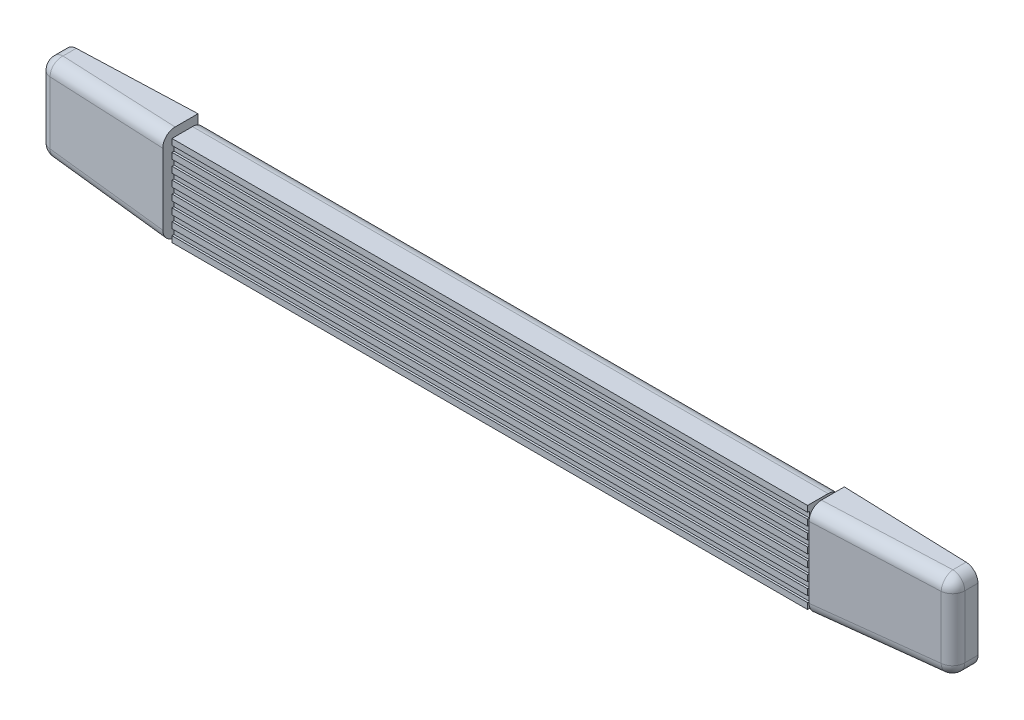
ISO-10303-21;
HEADER;
FILE_DESCRIPTION(('STEP AP214'),'2;1');
FILE_NAME('part.step','',(''),(''),'','','');
FILE_SCHEMA(('AUTOMOTIVE_DESIGN { 1 0 10303 214 1 1 1 1 }'));
ENDSEC;
DATA;
#1=APPLICATION_CONTEXT('core data for automotive mechanical design processes');
#2=APPLICATION_PROTOCOL_DEFINITION('international standard','automotive_design',2000,#1);
#3=PRODUCT_CONTEXT('',#1,'mechanical');
#4=PRODUCT('Part','Part','',(#3));
#5=PRODUCT_RELATED_PRODUCT_CATEGORY('part','',(#4));
#6=PRODUCT_DEFINITION_FORMATION('','',#4);
#7=PRODUCT_DEFINITION_CONTEXT('part definition',#1,'design');
#8=PRODUCT_DEFINITION('design','',#6,#7);
#9=PRODUCT_DEFINITION_SHAPE('','',#8);
#10=(LENGTH_UNIT() NAMED_UNIT(*) SI_UNIT(.MILLI.,.METRE.));
#11=(NAMED_UNIT(*) PLANE_ANGLE_UNIT() SI_UNIT($,.RADIAN.));
#12=(NAMED_UNIT(*) SI_UNIT($,.STERADIAN.) SOLID_ANGLE_UNIT());
#13=UNCERTAINTY_MEASURE_WITH_UNIT(LENGTH_MEASURE(1.E-05),#10,'distance_accuracy_value','');
#14=(GEOMETRIC_REPRESENTATION_CONTEXT(3) GLOBAL_UNCERTAINTY_ASSIGNED_CONTEXT((#13)) GLOBAL_UNIT_ASSIGNED_CONTEXT((#10,
#11,#12)) REPRESENTATION_CONTEXT('',''));
#15=CARTESIAN_POINT('',(0.,0.,0.));
#16=DIRECTION('',(0.,0.,1.));
#17=DIRECTION('',(1.,0.,0.));
#18=AXIS2_PLACEMENT_3D('',#15,#16,#17);
#19=CARTESIAN_POINT('',(0.,0.,3.));
#20=DIRECTION('',(0.,0.,-1.));
#21=DIRECTION('',(-1.,0.,0.));
#22=AXIS2_PLACEMENT_3D('',#19,#20,#21);
#23=PLANE('',#22);
#24=CARTESIAN_POINT('',(0.,0.,3.));
#25=DIRECTION('',(0.,0.,-1.));
#26=DIRECTION('',(-1.,0.,0.));
#27=AXIS2_PLACEMENT_3D('',#24,#25,#26);
#28=CIRCLE('',#27,2.25);
#29=CARTESIAN_POINT('',(-2.25,0.,3.));
#30=VERTEX_POINT('',#29);
#31=EDGE_CURVE('E1292',#30,#30,#28,.T.);
#32=ORIENTED_EDGE('',*,*,#31,.T.);
#33=EDGE_LOOP('',(#32));
#34=FACE_BOUND('',#33,.T.);
#35=ADVANCED_FACE('F14',(#34),#23,.T.);
#36=CARTESIAN_POINT('',(-14.9,7.60364995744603,0.));
#37=DIRECTION('',(0.,0.,-1.));
#38=DIRECTION('',(0.,1.,0.));
#39=AXIS2_PLACEMENT_3D('',#36,#37,#38);
#40=CYLINDRICAL_SURFACE('',#39,3.);
#41=CARTESIAN_POINT('',(-14.9,7.60364995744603,3.22906412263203));
#42=DIRECTION('',(0.,0.,-1.));
#43=DIRECTION('',(0.,1.,0.));
#44=AXIS2_PLACEMENT_3D('',#41,#42,#43);
#45=CIRCLE('',#44,3.);
#46=CARTESIAN_POINT('',(-17.9,7.60364995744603,3.22906412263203));
#47=VERTEX_POINT('',#46);
#48=CARTESIAN_POINT('',(-15.0054394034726,10.6017964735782,3.22906412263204));
#49=VERTEX_POINT('',#48);
#50=EDGE_CURVE('E1254',#47,#49,#45,.T.);
#51=ORIENTED_EDGE('',*,*,#50,.T.);
#52=DIRECTION('',(0.,0.,-1.));
#53=VECTOR('',#52,1.);
#54=CARTESIAN_POINT('',(-15.0054394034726,10.6017964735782,8.6));
#55=LINE('',#54,#53);
#56=CARTESIAN_POINT('',(-15.0054394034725,10.6017964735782,0.));
#57=VERTEX_POINT('',#56);
#58=EDGE_CURVE('E1222',#57,#49,#55,.F.);
#59=ORIENTED_EDGE('',*,*,#58,.F.);
#60=CARTESIAN_POINT('',(-14.9,7.60364995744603,0.));
#61=DIRECTION('',(0.,0.,1.));
#62=DIRECTION('',(0.,-1.,0.));
#63=AXIS2_PLACEMENT_3D('',#60,#61,#62);
#64=CIRCLE('',#63,3.);
#65=CARTESIAN_POINT('',(-17.9,7.60364995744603,0.));
#66=VERTEX_POINT('',#65);
#67=EDGE_CURVE('E1261',#66,#57,#64,.F.);
#68=ORIENTED_EDGE('',*,*,#67,.F.);
#69=DIRECTION('',(0.,0.,-1.));
#70=VECTOR('',#69,1.);
#71=CARTESIAN_POINT('',(-17.9,7.60364995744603,0.));
#72=LINE('',#71,#70);
#73=EDGE_CURVE('E1260',#47,#66,#72,.T.);
#74=ORIENTED_EDGE('',*,*,#73,.F.);
#75=EDGE_LOOP('',(#51,#59,#68,#74));
#76=FACE_BOUND('',#75,.T.);
#77=ADVANCED_FACE('F822',(#76),#40,.T.);
#78=CARTESIAN_POINT('',(-17.9,-11.65,0.));
#79=DIRECTION('',(-1.,0.,0.));
#80=DIRECTION('',(0.,-1.,0.));
#81=AXIS2_PLACEMENT_3D('',#78,#79,#80);
#82=PLANE('',#81);
#83=DIRECTION('',(0.,1.,0.));
#84=VECTOR('',#83,1.);
#85=CARTESIAN_POINT('',(-17.9,-11.65,3.22906412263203));
#86=LINE('',#85,#84);
#87=CARTESIAN_POINT('',(-17.9,-7.60364995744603,3.22906412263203));
#88=VERTEX_POINT('',#87);
#89=EDGE_CURVE('E1246',#88,#47,#86,.T.);
#90=ORIENTED_EDGE('',*,*,#89,.T.);
#91=ORIENTED_EDGE('',*,*,#73,.T.);
#92=DIRECTION('',(0.,1.,0.));
#93=VECTOR('',#92,1.);
#94=CARTESIAN_POINT('',(-17.9,-11.65,0.));
#95=LINE('',#94,#93);
#96=CARTESIAN_POINT('',(-17.9,-7.60364995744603,0.));
#97=VERTEX_POINT('',#96);
#98=EDGE_CURVE('E1275',#97,#66,#95,.T.);
#99=ORIENTED_EDGE('',*,*,#98,.F.);
#100=DIRECTION('',(0.,0.,-1.));
#101=VECTOR('',#100,1.);
#102=CARTESIAN_POINT('',(-17.9,-7.60364995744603,8.6));
#103=LINE('',#102,#101);
#104=EDGE_CURVE('E1245',#97,#88,#103,.F.);
#105=ORIENTED_EDGE('',*,*,#104,.T.);
#106=EDGE_LOOP('',(#90,#91,#99,#105));
#107=FACE_BOUND('',#106,.T.);
#108=ADVANCED_FACE('F829',(#107),#82,.T.);
#109=CARTESIAN_POINT('',(0.,0.,3.));
#110=DIRECTION('',(0.,0.,-1.));
#111=DIRECTION('',(-1.,0.,0.));
#112=AXIS2_PLACEMENT_3D('',#109,#110,#111);
#113=CYLINDRICAL_SURFACE('',#112,2.25);
#114=ORIENTED_EDGE('',*,*,#31,.F.);
#115=EDGE_LOOP('',(#114));
#116=FACE_BOUND('',#115,.T.);
#117=CARTESIAN_POINT('',(0.,0.,0.));
#118=DIRECTION('',(0.,0.,-1.));
#119=DIRECTION('',(-1.,0.,0.));
#120=AXIS2_PLACEMENT_3D('',#117,#118,#119);
#121=CIRCLE('',#120,2.25);
#122=CARTESIAN_POINT('',(-2.25,0.,0.));
#123=VERTEX_POINT('',#122);
#124=EDGE_CURVE('E743',#123,#123,#121,.T.);
#125=ORIENTED_EDGE('',*,*,#124,.T.);
#126=EDGE_LOOP('',(#125));
#127=FACE_BOUND('',#126,.T.);
#128=ADVANCED_FACE('F834',(#116,#127),#113,.F.);
#129=CARTESIAN_POINT('',(-14.9,-7.60364995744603,8.6));
#130=DIRECTION('',(0.,0.,1.));
#131=DIRECTION('',(0.,-1.,0.));
#132=AXIS2_PLACEMENT_3D('',#129,#130,#131);
#133=CYLINDRICAL_SURFACE('',#132,3.);
#134=CARTESIAN_POINT('',(-14.9,-7.60364995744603,3.22906412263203));
#135=DIRECTION('',(0.,0.,-1.));
#136=DIRECTION('',(0.,1.,0.));
#137=AXIS2_PLACEMENT_3D('',#134,#135,#136);
#138=CIRCLE('',#137,3.);
#139=CARTESIAN_POINT('',(-15.0054394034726,-10.6017964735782,3.22906412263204));
#140=VERTEX_POINT('',#139);
#141=EDGE_CURVE('E1282',#140,#88,#138,.T.);
#142=ORIENTED_EDGE('',*,*,#141,.T.);
#143=ORIENTED_EDGE('',*,*,#104,.F.);
#144=CARTESIAN_POINT('',(-14.9,-7.60364995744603,0.));
#145=DIRECTION('',(0.,0.,1.));
#146=DIRECTION('',(0.,-1.,0.));
#147=AXIS2_PLACEMENT_3D('',#144,#145,#146);
#148=CIRCLE('',#147,3.);
#149=CARTESIAN_POINT('',(-15.0054394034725,-10.6017964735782,0.));
#150=VERTEX_POINT('',#149);
#151=EDGE_CURVE('E1264',#150,#97,#148,.F.);
#152=ORIENTED_EDGE('',*,*,#151,.F.);
#153=DIRECTION('',(0.,0.,-1.));
#154=VECTOR('',#153,1.);
#155=CARTESIAN_POINT('',(-15.0054394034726,-10.6017964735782,8.6));
#156=LINE('',#155,#154);
#157=EDGE_CURVE('E1221',#140,#150,#156,.T.);
#158=ORIENTED_EDGE('',*,*,#157,.F.);
#159=EDGE_LOOP('',(#142,#143,#152,#158));
#160=FACE_BOUND('',#159,.T.);
#161=ADVANCED_FACE('F837',(#160),#133,.T.);
#162=CARTESIAN_POINT('',(-14.9,-7.60364995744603,3.22906412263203));
#163=DIRECTION('',(0.,-1.,0.));
#164=DIRECTION('',(1.,0.,0.));
#165=AXIS2_PLACEMENT_3D('',#162,#163,#164);
#166=SPHERICAL_SURFACE('',#165,3.);
#167=CARTESIAN_POINT('',(-14.9,-7.60364995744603,3.22906412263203));
#168=DIRECTION('',(-0.996241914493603,0.0350360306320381,-0.0792118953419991));
#169=DIRECTION('',(0.079260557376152,0.,-0.996853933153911));
#170=AXIS2_PLACEMENT_3D('',#167,#168,#169);
#171=CIRCLE('',#170,3.);
#172=CARTESIAN_POINT('',(-15.1377816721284,-7.60364995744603,6.21962592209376));
#173=VERTEX_POINT('',#172);
#174=EDGE_CURVE('E1219',#140,#173,#171,.T.);
#175=ORIENTED_EDGE('',*,*,#174,.T.);
#176=CARTESIAN_POINT('',(-14.9,-7.60364995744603,3.22906412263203));
#177=DIRECTION('',(0.,1.,0.));
#178=DIRECTION('',(-1.,0.,0.));
#179=AXIS2_PLACEMENT_3D('',#176,#177,#178);
#180=CIRCLE('',#179,3.);
#181=EDGE_CURVE('E1224',#88,#173,#180,.T.);
#182=ORIENTED_EDGE('',*,*,#181,.F.);
#183=ORIENTED_EDGE('',*,*,#141,.F.);
#184=EDGE_LOOP('',(#175,#182,#183));
#185=FACE_BOUND('',#184,.T.);
#186=ADVANCED_FACE('F847',(#185),#166,.T.);
#187=CARTESIAN_POINT('',(-14.9,-11.65,3.22906412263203));
#188=DIRECTION('',(0.,1.,0.));
#189=DIRECTION('',(-1.,0.,0.));
#190=AXIS2_PLACEMENT_3D('',#187,#188,#189);
#191=CYLINDRICAL_SURFACE('',#190,3.);
#192=DIRECTION('',(0.,1.,0.));
#193=VECTOR('',#192,1.);
#194=CARTESIAN_POINT('',(-15.1377816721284,-11.65,6.21962592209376));
#195=LINE('',#194,#193);
#196=CARTESIAN_POINT('',(-15.1377816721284,7.60364995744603,6.21962592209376));
#197=VERTEX_POINT('',#196);
#198=EDGE_CURVE('E1238',#197,#173,#195,.F.);
#199=ORIENTED_EDGE('',*,*,#198,.F.);
#200=CARTESIAN_POINT('',(-14.9,7.60364995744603,3.22906412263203));
#201=DIRECTION('',(0.,1.,0.));
#202=DIRECTION('',(-1.,0.,0.));
#203=AXIS2_PLACEMENT_3D('',#200,#201,#202);
#204=CIRCLE('',#203,3.);
#205=EDGE_CURVE('E1231',#197,#47,#204,.F.);
#206=ORIENTED_EDGE('',*,*,#205,.T.);
#207=ORIENTED_EDGE('',*,*,#89,.F.);
#208=ORIENTED_EDGE('',*,*,#181,.T.);
#209=EDGE_LOOP('',(#199,#206,#207,#208));
#210=FACE_BOUND('',#209,.T.);
#211=ADVANCED_FACE('F851',(#210),#191,.T.);
#212=CARTESIAN_POINT('',(-14.9,7.60364995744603,3.22906412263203));
#213=DIRECTION('',(0.,-1.,0.));
#214=DIRECTION('',(1.,0.,0.));
#215=AXIS2_PLACEMENT_3D('',#212,#213,#214);
#216=SPHERICAL_SURFACE('',#215,3.);
#217=ORIENTED_EDGE('',*,*,#205,.F.);
#218=CARTESIAN_POINT('',(-14.9,7.60364995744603,3.22906412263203));
#219=DIRECTION('',(-0.996241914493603,-0.0350360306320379,-0.0792118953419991));
#220=DIRECTION('',(0.079260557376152,0.,-0.996853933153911));
#221=AXIS2_PLACEMENT_3D('',#218,#219,#220);
#222=CIRCLE('',#221,3.);
#223=EDGE_CURVE('E1250',#197,#49,#222,.T.);
#224=ORIENTED_EDGE('',*,*,#223,.T.);
#225=ORIENTED_EDGE('',*,*,#50,.F.);
#226=EDGE_LOOP('',(#217,#224,#225));
#227=FACE_BOUND('',#226,.T.);
#228=ADVANCED_FACE('F859',(#227),#216,.T.);
#229=CARTESIAN_POINT('',(-17.9,10.5,8.6));
#230=DIRECTION('',(-0.0351464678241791,0.99938217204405,0.));
#231=DIRECTION('',(-0.999382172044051,-0.0351464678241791,0.));
#232=AXIS2_PLACEMENT_3D('',#229,#230,#231);
#233=PLANE('',#232);
#234=DIRECTION('',(-0.996241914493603,-0.035036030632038,-0.079211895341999));
#235=VECTOR('',#234,1.);
#236=CARTESIAN_POINT('',(-17.4579948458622,10.5155445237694,3.03405971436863));
#237=LINE('',#236,#235);
#238=CARTESIAN_POINT('',(14.7,11.6464831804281,5.59096450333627));
#239=VERTEX_POINT('',#238);
#240=EDGE_CURVE('E1226',#49,#239,#237,.F.);
#241=ORIENTED_EDGE('',*,*,#240,.T.);
#242=DIRECTION('',(0.,0.,-1.));
#243=VECTOR('',#242,1.);
#244=CARTESIAN_POINT('',(14.7,11.6464831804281,8.6));
#245=LINE('',#244,#243);
#246=CARTESIAN_POINT('',(14.7,11.6464831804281,0.));
#247=VERTEX_POINT('',#246);
#248=EDGE_CURVE('E1271',#239,#247,#245,.T.);
#249=ORIENTED_EDGE('',*,*,#248,.T.);
#250=DIRECTION('',(0.99938217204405,0.0351464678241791,0.));
#251=VECTOR('',#250,1.);
#252=CARTESIAN_POINT('',(-17.9,10.5,0.));
#253=LINE('',#252,#251);
#254=EDGE_CURVE('E1273',#57,#247,#253,.T.);
#255=ORIENTED_EDGE('',*,*,#254,.F.);
#256=ORIENTED_EDGE('',*,*,#58,.T.);
#257=EDGE_LOOP('',(#241,#249,#255,#256));
#258=FACE_BOUND('',#257,.T.);
#259=ADVANCED_FACE('F862',(#258),#233,.T.);
#260=CARTESIAN_POINT('',(-17.9,-11.65,0.));
#261=DIRECTION('',(0.,0.,1.));
#262=DIRECTION('',(0.,-1.,0.));
#263=AXIS2_PLACEMENT_3D('',#260,#261,#262);
#264=PLANE('',#263);
#265=ORIENTED_EDGE('',*,*,#124,.F.);
#266=EDGE_LOOP('',(#265));
#267=FACE_BOUND('',#266,.T.);
#268=DIRECTION('',(0.,1.,0.));
#269=VECTOR('',#268,1.);
#270=CARTESIAN_POINT('',(14.7,-11.65,0.));
#271=LINE('',#270,#269);
#272=CARTESIAN_POINT('',(14.7,-11.6464831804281,0.));
#273=VERTEX_POINT('',#272);
#274=EDGE_CURVE('E1286',#273,#247,#271,.T.);
#275=ORIENTED_EDGE('',*,*,#274,.F.);
#276=DIRECTION('',(0.99938217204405,-0.0351464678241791,0.));
#277=VECTOR('',#276,1.);
#278=CARTESIAN_POINT('',(-17.9,-10.5,0.));
#279=LINE('',#278,#277);
#280=EDGE_CURVE('E1215',#150,#273,#279,.T.);
#281=ORIENTED_EDGE('',*,*,#280,.F.);
#282=ORIENTED_EDGE('',*,*,#151,.T.);
#283=ORIENTED_EDGE('',*,*,#98,.T.);
#284=ORIENTED_EDGE('',*,*,#67,.T.);
#285=ORIENTED_EDGE('',*,*,#254,.T.);
#286=EDGE_LOOP('',(#275,#281,#282,#283,#284,#285));
#287=FACE_BOUND('',#286,.T.);
#288=ADVANCED_FACE('F872',(#267,#287),#264,.F.);
#289=CARTESIAN_POINT('',(-17.9,-10.5,8.6));
#290=DIRECTION('',(0.0351464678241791,0.99938217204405,0.));
#291=DIRECTION('',(-0.999382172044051,0.0351464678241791,0.));
#292=AXIS2_PLACEMENT_3D('',#289,#290,#291);
#293=PLANE('',#292);
#294=DIRECTION('',(0.,0.,-1.));
#295=VECTOR('',#294,1.);
#296=CARTESIAN_POINT('',(14.7,-11.6464831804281,8.6));
#297=LINE('',#296,#295);
#298=CARTESIAN_POINT('',(14.7,-11.6464831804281,5.59096450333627));
#299=VERTEX_POINT('',#298);
#300=EDGE_CURVE('E1202',#299,#273,#297,.T.);
#301=ORIENTED_EDGE('',*,*,#300,.F.);
#302=DIRECTION('',(-0.996241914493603,0.035036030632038,-0.079211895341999));
#303=VECTOR('',#302,1.);
#304=CARTESIAN_POINT('',(-17.4579948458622,-10.5155445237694,3.03405971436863));
#305=LINE('',#304,#303);
#306=EDGE_CURVE('E1212',#299,#140,#305,.T.);
#307=ORIENTED_EDGE('',*,*,#306,.T.);
#308=ORIENTED_EDGE('',*,*,#157,.T.);
#309=ORIENTED_EDGE('',*,*,#280,.T.);
#310=EDGE_LOOP('',(#301,#307,#308,#309));
#311=FACE_BOUND('',#310,.T.);
#312=ADVANCED_FACE('F856',(#311),#293,.F.);
#313=CARTESIAN_POINT('',(-17.3525554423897,-7.51739800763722,3.03405971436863));
#314=DIRECTION('',(0.996241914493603,-0.035036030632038,0.079211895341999));
#315=DIRECTION('',(-0.0792605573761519,0.,0.996853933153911));
#316=AXIS2_PLACEMENT_3D('',#313,#314,#315);
#317=CYLINDRICAL_SURFACE('',#316,3.);
#318=ORIENTED_EDGE('',*,*,#306,.F.);
#319=CARTESIAN_POINT('',(14.7,-8.6446285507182,5.58258094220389));
#320=DIRECTION('',(1.,0.,0.));
#321=DIRECTION('',(0.,-0.404506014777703,0.914535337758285));
#322=AXIS2_PLACEMENT_3D('',#319,#320,#321);
#323=ELLIPSE('',#322,3.01131678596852,3.);
#324=CARTESIAN_POINT('',(14.7,-8.65299090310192,8.59204892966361));
#325=VERTEX_POINT('',#324);
#326=EDGE_CURVE('E752',#299,#325,#323,.F.);
#327=ORIENTED_EDGE('',*,*,#326,.T.);
#328=DIRECTION('',(-0.996241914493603,0.035036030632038,-0.079211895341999));
#329=VECTOR('',#328,1.);
#330=CARTESIAN_POINT('',(-17.5903371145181,-7.51739800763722,6.02462151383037));
#331=LINE('',#330,#329);
#332=EDGE_CURVE('E1233',#173,#325,#331,.F.);
#333=ORIENTED_EDGE('',*,*,#332,.F.);
#334=ORIENTED_EDGE('',*,*,#174,.F.);
#335=EDGE_LOOP('',(#318,#327,#333,#334));
#336=FACE_BOUND('',#335,.T.);
#337=ADVANCED_FACE('F853',(#336),#317,.T.);
#338=CARTESIAN_POINT('',(-17.9,-11.65,6.));
#339=DIRECTION('',(-0.0792605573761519,0.,0.996853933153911));
#340=DIRECTION('',(-0.996853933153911,0.,-0.0792605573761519));
#341=AXIS2_PLACEMENT_3D('',#338,#339,#340);
#342=PLANE('',#341);
#343=ORIENTED_EDGE('',*,*,#332,.T.);
#344=DIRECTION('',(0.,1.,0.));
#345=VECTOR('',#344,1.);
#346=CARTESIAN_POINT('',(14.7,-11.65,8.59204892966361));
#347=LINE('',#346,#345);
#348=CARTESIAN_POINT('',(14.7,8.65299090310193,8.59204892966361));
#349=VERTEX_POINT('',#348);
#350=EDGE_CURVE('E1205',#325,#349,#347,.T.);
#351=ORIENTED_EDGE('',*,*,#350,.T.);
#352=DIRECTION('',(-0.996241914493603,-0.035036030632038,-0.079211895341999));
#353=VECTOR('',#352,1.);
#354=CARTESIAN_POINT('',(-18.5686456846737,7.48299266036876,5.94683551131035));
#355=LINE('',#354,#353);
#356=EDGE_CURVE('E1209',#349,#197,#355,.T.);
#357=ORIENTED_EDGE('',*,*,#356,.T.);
#358=ORIENTED_EDGE('',*,*,#198,.T.);
#359=EDGE_LOOP('',(#343,#351,#357,#358));
#360=FACE_BOUND('',#359,.T.);
#361=ADVANCED_FACE('F855',(#360),#342,.T.);
#362=CARTESIAN_POINT('',(-18.3308640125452,7.48299266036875,2.95627371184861));
#363=DIRECTION('',(-0.996241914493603,-0.035036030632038,-0.079211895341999));
#364=DIRECTION('',(0.0792605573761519,0.,-0.996853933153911));
#365=AXIS2_PLACEMENT_3D('',#362,#363,#364);
#366=CYLINDRICAL_SURFACE('',#365,3.);
#367=ORIENTED_EDGE('',*,*,#356,.F.);
#368=CARTESIAN_POINT('',(14.7,8.6446285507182,5.58258094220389));
#369=DIRECTION('',(1.,0.,0.));
#370=DIRECTION('',(0.,-0.404506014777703,-0.914535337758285));
#371=AXIS2_PLACEMENT_3D('',#368,#369,#370);
#372=ELLIPSE('',#371,3.01131678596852,3.);
#373=EDGE_CURVE('E1216',#349,#239,#372,.F.);
#374=ORIENTED_EDGE('',*,*,#373,.T.);
#375=ORIENTED_EDGE('',*,*,#240,.F.);
#376=ORIENTED_EDGE('',*,*,#223,.F.);
#377=EDGE_LOOP('',(#367,#374,#375,#376));
#378=FACE_BOUND('',#377,.T.);
#379=ADVANCED_FACE('F843',(#378),#366,.T.);
#380=CARTESIAN_POINT('',(14.7,0.,0.));
#381=DIRECTION('',(1.,0.,0.));
#382=DIRECTION('',(0.,0.,-1.));
#383=AXIS2_PLACEMENT_3D('',#380,#381,#382);
#384=PLANE('',#383);
#385=ORIENTED_EDGE('',*,*,#373,.F.);
#386=ORIENTED_EDGE('',*,*,#350,.F.);
#387=ORIENTED_EDGE('',*,*,#326,.F.);
#388=ORIENTED_EDGE('',*,*,#300,.T.);
#389=ORIENTED_EDGE('',*,*,#274,.T.);
#390=ORIENTED_EDGE('',*,*,#248,.F.);
#391=EDGE_LOOP('',(#385,#386,#387,#388,#389,#390));
#392=FACE_BOUND('',#391,.T.);
#393=DIRECTION('',(0.,1.,0.));
#394=VECTOR('',#393,1.);
#395=CARTESIAN_POINT('',(14.7,-9.,5.5));
#396=LINE('',#395,#394);
#397=CARTESIAN_POINT('',(14.7,-9.,5.5));
#398=VERTEX_POINT('',#397);
#399=CARTESIAN_POINT('',(14.7,9.,5.5));
#400=VERTEX_POINT('',#399);
#401=EDGE_CURVE('E749',#398,#400,#396,.T.);
#402=ORIENTED_EDGE('',*,*,#401,.T.);
#403=DIRECTION('',(0.,0.,-1.));
#404=VECTOR('',#403,1.);
#405=CARTESIAN_POINT('',(14.7,9.,5.5));
#406=LINE('',#405,#404);
#407=CARTESIAN_POINT('',(14.7,9.,2.));
#408=VERTEX_POINT('',#407);
#409=EDGE_CURVE('E9',#400,#408,#406,.T.);
#410=ORIENTED_EDGE('',*,*,#409,.T.);
#411=DIRECTION('',(0.,-1.,0.));
#412=VECTOR('',#411,1.);
#413=CARTESIAN_POINT('',(14.7,9.,2.));
#414=LINE('',#413,#412);
#415=CARTESIAN_POINT('',(14.7,-9.,2.));
#416=VERTEX_POINT('',#415);
#417=EDGE_CURVE('E24',#408,#416,#414,.T.);
#418=ORIENTED_EDGE('',*,*,#417,.T.);
#419=DIRECTION('',(0.,0.,1.));
#420=VECTOR('',#419,1.);
#421=CARTESIAN_POINT('',(14.7,-9.,2.));
#422=LINE('',#421,#420);
#423=EDGE_CURVE('E746',#416,#398,#422,.T.);
#424=ORIENTED_EDGE('',*,*,#423,.T.);
#425=EDGE_LOOP('',(#402,#410,#418,#424));
#426=FACE_BOUND('',#425,.T.);
#427=ADVANCED_FACE('F839',(#392,#426),#384,.T.);
#428=CARTESIAN_POINT('',(187.,0.,3.));
#429=DIRECTION('',(0.,0.,-1.));
#430=DIRECTION('',(-1.,0.,0.));
#431=AXIS2_PLACEMENT_3D('',#428,#429,#430);
#432=PLANE('',#431);
#433=CARTESIAN_POINT('',(187.,0.,3.));
#434=DIRECTION('',(0.,0.,-1.));
#435=DIRECTION('',(-1.,0.,0.));
#436=AXIS2_PLACEMENT_3D('',#433,#434,#435);
#437=CIRCLE('',#436,2.25);
#438=CARTESIAN_POINT('',(184.75,0.,3.));
#439=VERTEX_POINT('',#438);
#440=EDGE_CURVE('E656',#439,#439,#437,.T.);
#441=ORIENTED_EDGE('',*,*,#440,.T.);
#442=EDGE_LOOP('',(#441));
#443=FACE_BOUND('',#442,.T.);
#444=ADVANCED_FACE('F842',(#443),#432,.T.);
#445=CARTESIAN_POINT('',(201.9,7.60364995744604,3.22906412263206));
#446=DIRECTION('',(0.,-1.,0.));
#447=DIRECTION('',(1.,0.,0.));
#448=AXIS2_PLACEMENT_3D('',#445,#446,#447);
#449=SPHERICAL_SURFACE('',#448,3.);
#450=CARTESIAN_POINT('',(201.9,7.60364995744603,3.22906412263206));
#451=DIRECTION('',(0.996241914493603,-0.0350360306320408,-0.079211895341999));
#452=DIRECTION('',(0.0792605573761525,0.,0.996853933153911));
#453=AXIS2_PLACEMENT_3D('',#450,#451,#452);
#454=CIRCLE('',#453,3.);
#455=CARTESIAN_POINT('',(202.005439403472,10.6017964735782,3.22906412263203));
#456=VERTEX_POINT('',#455);
#457=CARTESIAN_POINT('',(202.137781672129,7.60364995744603,6.21962592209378));
#458=VERTEX_POINT('',#457);
#459=EDGE_CURVE('E686',#456,#458,#454,.T.);
#460=ORIENTED_EDGE('',*,*,#459,.T.);
#461=CARTESIAN_POINT('',(201.9,7.60364995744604,3.22906412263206));
#462=DIRECTION('',(0.,1.,0.));
#463=DIRECTION('',(-1.,0.,0.));
#464=AXIS2_PLACEMENT_3D('',#461,#462,#463);
#465=CIRCLE('',#464,3.);
#466=CARTESIAN_POINT('',(204.9,7.60364995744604,3.22906412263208));
#467=VERTEX_POINT('',#466);
#468=EDGE_CURVE('E725',#467,#458,#465,.F.);
#469=ORIENTED_EDGE('',*,*,#468,.F.);
#470=CARTESIAN_POINT('',(201.9,7.60364995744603,3.22906412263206));
#471=DIRECTION('',(0.,0.,-1.));
#472=DIRECTION('',(0.,1.,0.));
#473=AXIS2_PLACEMENT_3D('',#470,#471,#472);
#474=CIRCLE('',#473,3.);
#475=EDGE_CURVE('E683',#456,#467,#474,.T.);
#476=ORIENTED_EDGE('',*,*,#475,.F.);
#477=EDGE_LOOP('',(#460,#469,#476));
#478=FACE_BOUND('',#477,.T.);
#479=ADVANCED_FACE('F805',(#478),#449,.T.);
#480=CARTESIAN_POINT('',(201.9,-11.65,3.22906412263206));
#481=DIRECTION('',(0.,1.,0.));
#482=DIRECTION('',(-1.,0.,0.));
#483=AXIS2_PLACEMENT_3D('',#480,#481,#482);
#484=CYLINDRICAL_SURFACE('',#483,3.);
#485=DIRECTION('',(0.,1.,0.));
#486=VECTOR('',#485,1.);
#487=CARTESIAN_POINT('',(204.9,-11.65,3.22906412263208));
#488=LINE('',#487,#486);
#489=CARTESIAN_POINT('',(204.9,-7.60364995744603,3.22906412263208));
#490=VERTEX_POINT('',#489);
#491=EDGE_CURVE('E701',#467,#490,#488,.F.);
#492=ORIENTED_EDGE('',*,*,#491,.F.);
#493=ORIENTED_EDGE('',*,*,#468,.T.);
#494=DIRECTION('',(0.,1.,0.));
#495=VECTOR('',#494,1.);
#496=CARTESIAN_POINT('',(202.137781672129,-11.65,6.21962592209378));
#497=LINE('',#496,#495);
#498=CARTESIAN_POINT('',(202.137781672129,-7.60364995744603,6.21962592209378));
#499=VERTEX_POINT('',#498);
#500=EDGE_CURVE('E698',#499,#458,#497,.T.);
#501=ORIENTED_EDGE('',*,*,#500,.F.);
#502=CARTESIAN_POINT('',(201.9,-7.60364995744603,3.22906412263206));
#503=DIRECTION('',(0.,1.,0.));
#504=DIRECTION('',(-1.,0.,0.));
#505=AXIS2_PLACEMENT_3D('',#502,#503,#504);
#506=CIRCLE('',#505,3.);
#507=EDGE_CURVE('E723',#499,#490,#506,.T.);
#508=ORIENTED_EDGE('',*,*,#507,.T.);
#509=EDGE_LOOP('',(#492,#493,#501,#508));
#510=FACE_BOUND('',#509,.T.);
#511=ADVANCED_FACE('F802',(#510),#484,.T.);
#512=CARTESIAN_POINT('',(201.9,-7.60364995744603,3.22906412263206));
#513=DIRECTION('',(0.,-1.,0.));
#514=DIRECTION('',(1.,0.,0.));
#515=AXIS2_PLACEMENT_3D('',#512,#513,#514);
#516=SPHERICAL_SURFACE('',#515,3.);
#517=ORIENTED_EDGE('',*,*,#507,.F.);
#518=CARTESIAN_POINT('',(201.9,-7.60364995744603,3.22906412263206));
#519=DIRECTION('',(0.996241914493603,0.0350360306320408,-0.079211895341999));
#520=DIRECTION('',(0.0792605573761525,0.,0.996853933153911));
#521=AXIS2_PLACEMENT_3D('',#518,#519,#520);
#522=CIRCLE('',#521,3.);
#523=CARTESIAN_POINT('',(202.005439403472,-10.6017964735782,3.22906412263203));
#524=VERTEX_POINT('',#523);
#525=EDGE_CURVE('E680',#499,#524,#522,.T.);
#526=ORIENTED_EDGE('',*,*,#525,.T.);
#527=CARTESIAN_POINT('',(201.9,-7.60364995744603,3.22906412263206));
#528=DIRECTION('',(0.,0.,-1.));
#529=DIRECTION('',(0.,1.,0.));
#530=AXIS2_PLACEMENT_3D('',#527,#528,#529);
#531=CIRCLE('',#530,3.);
#532=EDGE_CURVE('E677',#490,#524,#531,.T.);
#533=ORIENTED_EDGE('',*,*,#532,.F.);
#534=EDGE_LOOP('',(#517,#526,#533));
#535=FACE_BOUND('',#534,.T.);
#536=ADVANCED_FACE('F894',(#535),#516,.T.);
#537=CARTESIAN_POINT('',(201.9,-7.60364995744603,0.));
#538=DIRECTION('',(0.,0.,1.));
#539=DIRECTION('',(0.,-1.,0.));
#540=AXIS2_PLACEMENT_3D('',#537,#538,#539);
#541=CYLINDRICAL_SURFACE('',#540,3.);
#542=ORIENTED_EDGE('',*,*,#532,.T.);
#543=DIRECTION('',(0.,0.,-1.));
#544=VECTOR('',#543,1.);
#545=CARTESIAN_POINT('',(202.005439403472,-10.6017964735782,0.));
#546=LINE('',#545,#544);
#547=CARTESIAN_POINT('',(202.005439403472,-10.6017964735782,0.));
#548=VERTEX_POINT('',#547);
#549=EDGE_CURVE('E721',#548,#524,#546,.F.);
#550=ORIENTED_EDGE('',*,*,#549,.F.);
#551=CARTESIAN_POINT('',(201.9,-7.60364995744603,0.));
#552=DIRECTION('',(0.,0.,-1.));
#553=DIRECTION('',(0.,1.,0.));
#554=AXIS2_PLACEMENT_3D('',#551,#552,#553);
#555=CIRCLE('',#554,3.);
#556=CARTESIAN_POINT('',(204.9,-7.60364995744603,0.));
#557=VERTEX_POINT('',#556);
#558=EDGE_CURVE('E709',#557,#548,#555,.T.);
#559=ORIENTED_EDGE('',*,*,#558,.F.);
#560=DIRECTION('',(0.,0.,-1.));
#561=VECTOR('',#560,1.);
#562=CARTESIAN_POINT('',(204.9,-7.60364995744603,0.));
#563=LINE('',#562,#561);
#564=EDGE_CURVE('E713',#490,#557,#563,.T.);
#565=ORIENTED_EDGE('',*,*,#564,.F.);
#566=EDGE_LOOP('',(#542,#550,#559,#565));
#567=FACE_BOUND('',#566,.T.);
#568=ADVANCED_FACE('F786',(#567),#541,.T.);
#569=CARTESIAN_POINT('',(204.9,-11.65,0.));
#570=DIRECTION('',(-1.,0.,0.));
#571=DIRECTION('',(0.,-1.,0.));
#572=AXIS2_PLACEMENT_3D('',#569,#570,#571);
#573=PLANE('',#572);
#574=DIRECTION('',(0.,1.,0.));
#575=VECTOR('',#574,1.);
#576=CARTESIAN_POINT('',(204.9,-11.65,0.));
#577=LINE('',#576,#575);
#578=CARTESIAN_POINT('',(204.9,7.60364995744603,0.));
#579=VERTEX_POINT('',#578);
#580=EDGE_CURVE('E695',#557,#579,#577,.T.);
#581=ORIENTED_EDGE('',*,*,#580,.T.);
#582=DIRECTION('',(0.,0.,-1.));
#583=VECTOR('',#582,1.);
#584=CARTESIAN_POINT('',(204.9,7.60364995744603,0.));
#585=LINE('',#584,#583);
#586=EDGE_CURVE('E716',#579,#467,#585,.F.);
#587=ORIENTED_EDGE('',*,*,#586,.T.);
#588=ORIENTED_EDGE('',*,*,#491,.T.);
#589=ORIENTED_EDGE('',*,*,#564,.T.);
#590=EDGE_LOOP('',(#581,#587,#588,#589));
#591=FACE_BOUND('',#590,.T.);
#592=ADVANCED_FACE('F781',(#591),#573,.F.);
#593=CARTESIAN_POINT('',(187.,0.,3.));
#594=DIRECTION('',(0.,0.,-1.));
#595=DIRECTION('',(-1.,0.,0.));
#596=AXIS2_PLACEMENT_3D('',#593,#594,#595);
#597=CYLINDRICAL_SURFACE('',#596,2.25);
#598=ORIENTED_EDGE('',*,*,#440,.F.);
#599=EDGE_LOOP('',(#598));
#600=FACE_BOUND('',#599,.T.);
#601=CARTESIAN_POINT('',(187.,0.,0.));
#602=DIRECTION('',(0.,0.,-1.));
#603=DIRECTION('',(-1.,0.,0.));
#604=AXIS2_PLACEMENT_3D('',#601,#602,#603);
#605=CIRCLE('',#604,2.25);
#606=CARTESIAN_POINT('',(184.75,0.,0.));
#607=VERTEX_POINT('',#606);
#608=EDGE_CURVE('E651',#607,#607,#605,.T.);
#609=ORIENTED_EDGE('',*,*,#608,.T.);
#610=EDGE_LOOP('',(#609));
#611=FACE_BOUND('',#610,.T.);
#612=ADVANCED_FACE('F817',(#600,#611),#597,.F.);
#613=CARTESIAN_POINT('',(201.9,7.60364995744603,15.6340507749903));
#614=DIRECTION('',(0.,0.,-1.));
#615=DIRECTION('',(0.,1.,0.));
#616=AXIS2_PLACEMENT_3D('',#613,#614,#615);
#617=CYLINDRICAL_SURFACE('',#616,3.);
#618=ORIENTED_EDGE('',*,*,#475,.T.);
#619=ORIENTED_EDGE('',*,*,#586,.F.);
#620=CARTESIAN_POINT('',(201.9,7.60364995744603,0.));
#621=DIRECTION('',(0.,0.,-1.));
#622=DIRECTION('',(0.,1.,0.));
#623=AXIS2_PLACEMENT_3D('',#620,#621,#622);
#624=CIRCLE('',#623,3.);
#625=CARTESIAN_POINT('',(202.005439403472,10.6017964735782,0.));
#626=VERTEX_POINT('',#625);
#627=EDGE_CURVE('E711',#626,#579,#624,.T.);
#628=ORIENTED_EDGE('',*,*,#627,.F.);
#629=DIRECTION('',(0.,0.,-1.));
#630=VECTOR('',#629,1.);
#631=CARTESIAN_POINT('',(202.005439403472,10.6017964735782,15.6340507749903));
#632=LINE('',#631,#630);
#633=EDGE_CURVE('E706',#456,#626,#632,.T.);
#634=ORIENTED_EDGE('',*,*,#633,.F.);
#635=EDGE_LOOP('',(#618,#619,#628,#634));
#636=FACE_BOUND('',#635,.T.);
#637=ADVANCED_FACE('F776',(#636),#617,.T.);
#638=CARTESIAN_POINT('',(205.330864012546,7.48299266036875,2.9562737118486));
#639=DIRECTION('',(-0.996241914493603,0.035036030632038,0.079211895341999));
#640=DIRECTION('',(-0.079260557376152,0.,-0.996853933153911));
#641=AXIS2_PLACEMENT_3D('',#638,#639,#640);
#642=CYLINDRICAL_SURFACE('',#641,3.);
#643=DIRECTION('',(-0.996241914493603,0.035036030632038,0.079211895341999));
#644=VECTOR('',#643,1.);
#645=CARTESIAN_POINT('',(203.902908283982,10.5350659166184,3.0781950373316));
#646=LINE('',#645,#644);
#647=CARTESIAN_POINT('',(172.3,11.6464831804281,5.59096450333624));
#648=VERTEX_POINT('',#647);
#649=EDGE_CURVE('E704',#648,#456,#646,.F.);
#650=ORIENTED_EDGE('',*,*,#649,.F.);
#651=CARTESIAN_POINT('',(172.3,8.64462855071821,5.5825809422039));
#652=DIRECTION('',(-1.,0.,0.));
#653=DIRECTION('',(0.,0.404506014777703,0.914535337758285));
#654=AXIS2_PLACEMENT_3D('',#651,#652,#653);
#655=ELLIPSE('',#654,3.01131678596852,3.);
#656=CARTESIAN_POINT('',(172.3,8.65299090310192,8.59204892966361));
#657=VERTEX_POINT('',#656);
#658=EDGE_CURVE('E672',#648,#657,#655,.F.);
#659=ORIENTED_EDGE('',*,*,#658,.T.);
#660=DIRECTION('',(-0.996241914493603,0.035036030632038,0.079211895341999));
#661=VECTOR('',#660,1.);
#662=CARTESIAN_POINT('',(205.568645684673,7.48299266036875,5.94683551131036));
#663=LINE('',#662,#661);
#664=EDGE_CURVE('E729',#458,#657,#663,.T.);
#665=ORIENTED_EDGE('',*,*,#664,.F.);
#666=ORIENTED_EDGE('',*,*,#459,.F.);
#667=EDGE_LOOP('',(#650,#659,#665,#666));
#668=FACE_BOUND('',#667,.T.);
#669=ADVANCED_FACE('F807',(#668),#642,.T.);
#670=CARTESIAN_POINT('',(204.9,-11.65,6.));
#671=DIRECTION('',(-0.079260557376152,0.,-0.996853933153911));
#672=DIRECTION('',(0.996853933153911,0.,-0.079260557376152));
#673=AXIS2_PLACEMENT_3D('',#670,#671,#672);
#674=PLANE('',#673);
#675=DIRECTION('',(0.,1.,0.));
#676=VECTOR('',#675,1.);
#677=CARTESIAN_POINT('',(172.3,-11.65,8.59204892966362));
#678=LINE('',#677,#676);
#679=CARTESIAN_POINT('',(172.3,-8.65299090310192,8.59204892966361));
#680=VERTEX_POINT('',#679);
#681=EDGE_CURVE('E667',#680,#657,#678,.T.);
#682=ORIENTED_EDGE('',*,*,#681,.F.);
#683=DIRECTION('',(-0.996241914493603,-0.035036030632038,0.079211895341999));
#684=VECTOR('',#683,1.);
#685=CARTESIAN_POINT('',(204.035250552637,-7.53691940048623,6.06875683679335));
#686=LINE('',#685,#684);
#687=EDGE_CURVE('E727',#680,#499,#686,.F.);
#688=ORIENTED_EDGE('',*,*,#687,.T.);
#689=ORIENTED_EDGE('',*,*,#500,.T.);
#690=ORIENTED_EDGE('',*,*,#664,.T.);
#691=EDGE_LOOP('',(#682,#688,#689,#690));
#692=FACE_BOUND('',#691,.T.);
#693=ADVANCED_FACE('F799',(#692),#674,.F.);
#694=CARTESIAN_POINT('',(203.797468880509,-7.53691940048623,3.07819503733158));
#695=DIRECTION('',(0.996241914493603,0.035036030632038,-0.079211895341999));
#696=DIRECTION('',(0.079260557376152,0.,0.996853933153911));
#697=AXIS2_PLACEMENT_3D('',#694,#695,#696);
#698=CYLINDRICAL_SURFACE('',#697,3.);
#699=ORIENTED_EDGE('',*,*,#687,.F.);
#700=CARTESIAN_POINT('',(172.3,-8.64462855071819,5.58258094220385));
#701=DIRECTION('',(-1.,0.,0.));
#702=DIRECTION('',(0.,0.404506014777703,-0.914535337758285));
#703=AXIS2_PLACEMENT_3D('',#700,#701,#702);
#704=ELLIPSE('',#703,3.01131678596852,3.);
#705=CARTESIAN_POINT('',(172.3,-11.6464831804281,5.59096450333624));
#706=VERTEX_POINT('',#705);
#707=EDGE_CURVE('E732',#680,#706,#704,.F.);
#708=ORIENTED_EDGE('',*,*,#707,.T.);
#709=DIRECTION('',(-0.996241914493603,-0.035036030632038,0.079211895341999));
#710=VECTOR('',#709,1.);
#711=CARTESIAN_POINT('',(203.902908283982,-10.5350659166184,3.0781950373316));
#712=LINE('',#711,#710);
#713=EDGE_CURVE('E718',#524,#706,#712,.T.);
#714=ORIENTED_EDGE('',*,*,#713,.F.);
#715=ORIENTED_EDGE('',*,*,#525,.F.);
#716=EDGE_LOOP('',(#699,#708,#714,#715));
#717=FACE_BOUND('',#716,.T.);
#718=ADVANCED_FACE('F794',(#717),#698,.T.);
#719=CARTESIAN_POINT('',(204.9,-10.5,15.6340507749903));
#720=DIRECTION('',(0.0351464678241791,-0.99938217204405,0.));
#721=DIRECTION('',(0.99938217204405,0.0351464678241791,0.));
#722=AXIS2_PLACEMENT_3D('',#719,#720,#721);
#723=PLANE('',#722);
#724=ORIENTED_EDGE('',*,*,#713,.T.);
#725=DIRECTION('',(0.,0.,-1.));
#726=VECTOR('',#725,1.);
#727=CARTESIAN_POINT('',(172.3,-11.6464831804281,15.6340507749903));
#728=LINE('',#727,#726);
#729=CARTESIAN_POINT('',(172.3,-11.6464831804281,0.));
#730=VERTEX_POINT('',#729);
#731=EDGE_CURVE('E661',#706,#730,#728,.T.);
#732=ORIENTED_EDGE('',*,*,#731,.T.);
#733=DIRECTION('',(-0.99938217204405,-0.0351464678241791,0.));
#734=VECTOR('',#733,1.);
#735=CARTESIAN_POINT('',(204.9,-10.5,0.));
#736=LINE('',#735,#734);
#737=EDGE_CURVE('E692',#548,#730,#736,.T.);
#738=ORIENTED_EDGE('',*,*,#737,.F.);
#739=ORIENTED_EDGE('',*,*,#549,.T.);
#740=EDGE_LOOP('',(#724,#732,#738,#739));
#741=FACE_BOUND('',#740,.T.);
#742=ADVANCED_FACE('F789',(#741),#723,.T.);
#743=CARTESIAN_POINT('',(204.9,-11.65,0.));
#744=DIRECTION('',(0.,0.,-1.));
#745=DIRECTION('',(0.,1.,0.));
#746=AXIS2_PLACEMENT_3D('',#743,#744,#745);
#747=PLANE('',#746);
#748=ORIENTED_EDGE('',*,*,#608,.F.);
#749=EDGE_LOOP('',(#748));
#750=FACE_BOUND('',#749,.T.);
#751=ORIENTED_EDGE('',*,*,#737,.T.);
#752=DIRECTION('',(0.,1.,0.));
#753=VECTOR('',#752,1.);
#754=CARTESIAN_POINT('',(172.3,-11.65,0.));
#755=LINE('',#754,#753);
#756=CARTESIAN_POINT('',(172.3,11.6464831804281,0.));
#757=VERTEX_POINT('',#756);
#758=EDGE_CURVE('E669',#730,#757,#755,.T.);
#759=ORIENTED_EDGE('',*,*,#758,.T.);
#760=DIRECTION('',(-0.99938217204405,0.0351464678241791,0.));
#761=VECTOR('',#760,1.);
#762=CARTESIAN_POINT('',(204.9,10.5,0.));
#763=LINE('',#762,#761);
#764=EDGE_CURVE('E689',#626,#757,#763,.T.);
#765=ORIENTED_EDGE('',*,*,#764,.F.);
#766=ORIENTED_EDGE('',*,*,#627,.T.);
#767=ORIENTED_EDGE('',*,*,#580,.F.);
#768=ORIENTED_EDGE('',*,*,#558,.T.);
#769=EDGE_LOOP('',(#751,#759,#765,#766,#767,#768));
#770=FACE_BOUND('',#769,.T.);
#771=ADVANCED_FACE('F771',(#750,#770),#747,.T.);
#772=CARTESIAN_POINT('',(204.9,10.5,15.6340507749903));
#773=DIRECTION('',(-0.0351464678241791,-0.99938217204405,0.));
#774=DIRECTION('',(0.99938217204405,-0.0351464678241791,0.));
#775=AXIS2_PLACEMENT_3D('',#772,#773,#774);
#776=PLANE('',#775);
#777=DIRECTION('',(0.,0.,-1.));
#778=VECTOR('',#777,1.);
#779=CARTESIAN_POINT('',(172.3,11.6464831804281,15.6340507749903));
#780=LINE('',#779,#778);
#781=EDGE_CURVE('E675',#648,#757,#780,.T.);
#782=ORIENTED_EDGE('',*,*,#781,.F.);
#783=ORIENTED_EDGE('',*,*,#649,.T.);
#784=ORIENTED_EDGE('',*,*,#633,.T.);
#785=ORIENTED_EDGE('',*,*,#764,.T.);
#786=EDGE_LOOP('',(#782,#783,#784,#785));
#787=FACE_BOUND('',#786,.T.);
#788=ADVANCED_FACE('F763',(#787),#776,.F.);
#789=CARTESIAN_POINT('',(172.3,0.,0.));
#790=DIRECTION('',(-1.,0.,0.));
#791=DIRECTION('',(0.,0.,1.));
#792=AXIS2_PLACEMENT_3D('',#789,#790,#791);
#793=PLANE('',#792);
#794=DIRECTION('',(0.,0.,-1.));
#795=VECTOR('',#794,1.);
#796=CARTESIAN_POINT('',(172.3,9.,0.));
#797=LINE('',#796,#795);
#798=CARTESIAN_POINT('',(172.3,9.,5.5));
#799=VERTEX_POINT('',#798);
#800=CARTESIAN_POINT('',(172.3,9.,2.));
#801=VERTEX_POINT('',#800);
#802=EDGE_CURVE('E741',#799,#801,#797,.T.);
#803=ORIENTED_EDGE('',*,*,#802,.F.);
#804=DIRECTION('',(0.,-1.,0.));
#805=VECTOR('',#804,1.);
#806=CARTESIAN_POINT('',(172.3,0.,5.5));
#807=LINE('',#806,#805);
#808=CARTESIAN_POINT('',(172.3,-9.,5.5));
#809=VERTEX_POINT('',#808);
#810=EDGE_CURVE('E738',#799,#809,#807,.T.);
#811=ORIENTED_EDGE('',*,*,#810,.T.);
#812=DIRECTION('',(0.,0.,1.));
#813=VECTOR('',#812,1.);
#814=CARTESIAN_POINT('',(172.3,-9.,0.));
#815=LINE('',#814,#813);
#816=CARTESIAN_POINT('',(172.3,-9.,2.));
#817=VERTEX_POINT('',#816);
#818=EDGE_CURVE('E736',#817,#809,#815,.T.);
#819=ORIENTED_EDGE('',*,*,#818,.F.);
#820=DIRECTION('',(0.,1.,0.));
#821=VECTOR('',#820,1.);
#822=CARTESIAN_POINT('',(172.3,0.,2.));
#823=LINE('',#822,#821);
#824=EDGE_CURVE('E336',#817,#801,#823,.T.);
#825=ORIENTED_EDGE('',*,*,#824,.T.);
#826=EDGE_LOOP('',(#803,#811,#819,#825));
#827=FACE_BOUND('',#826,.T.);
#828=ORIENTED_EDGE('',*,*,#781,.T.);
#829=ORIENTED_EDGE('',*,*,#758,.F.);
#830=ORIENTED_EDGE('',*,*,#731,.F.);
#831=ORIENTED_EDGE('',*,*,#707,.F.);
#832=ORIENTED_EDGE('',*,*,#681,.T.);
#833=ORIENTED_EDGE('',*,*,#658,.F.);
#834=EDGE_LOOP('',(#828,#829,#830,#831,#832,#833));
#835=FACE_BOUND('',#834,.T.);
#836=ADVANCED_FACE('F760',(#827,#835),#793,.T.);
#837=CARTESIAN_POINT('',(172.3,9.,5.5));
#838=DIRECTION('',(0.,0.,-1.));
#839=DIRECTION('',(0.,1.,0.));
#840=AXIS2_PLACEMENT_3D('',#837,#838,#839);
#841=PLANE('',#840);
#842=ORIENTED_EDGE('',*,*,#810,.F.);
#843=DIRECTION('',(-1.,0.,0.));
#844=VECTOR('',#843,1.);
#845=CARTESIAN_POINT('',(172.3,9.,5.5));
#846=LINE('',#845,#844);
#847=CARTESIAN_POINT('',(171.1,9.,5.5));
#848=VERTEX_POINT('',#847);
#849=EDGE_CURVE('E360',#799,#848,#846,.T.);
#850=ORIENTED_EDGE('',*,*,#849,.T.);
#851=DIRECTION('',(0.,-1.,0.));
#852=VECTOR('',#851,1.);
#853=CARTESIAN_POINT('',(171.1,9.,5.5));
#854=LINE('',#853,#852);
#855=CARTESIAN_POINT('',(171.1,-9.,5.5));
#856=VERTEX_POINT('',#855);
#857=EDGE_CURVE('E349',#848,#856,#854,.T.);
#858=ORIENTED_EDGE('',*,*,#857,.T.);
#859=DIRECTION('',(-1.,0.,0.));
#860=VECTOR('',#859,1.);
#861=CARTESIAN_POINT('',(172.3,-9.,5.5));
#862=LINE('',#861,#860);
#863=EDGE_CURVE('E339',#809,#856,#862,.T.);
#864=ORIENTED_EDGE('',*,*,#863,.F.);
#865=EDGE_LOOP('',(#842,#850,#858,#864));
#866=FACE_BOUND('',#865,.T.);
#867=ADVANCED_FACE('F755',(#866),#841,.F.);
#868=CARTESIAN_POINT('',(172.3,-9.,2.));
#869=DIRECTION('',(0.,-1.,0.));
#870=DIRECTION('',(1.,0.,0.));
#871=AXIS2_PLACEMENT_3D('',#868,#869,#870);
#872=PLANE('',#871);
#873=DIRECTION('',(-1.,0.,0.));
#874=VECTOR('',#873,1.);
#875=CARTESIAN_POINT('',(172.3,-9.,2.));
#876=LINE('',#875,#874);
#877=CARTESIAN_POINT('',(171.1,-9.,2.));
#878=VERTEX_POINT('',#877);
#879=EDGE_CURVE('E329',#817,#878,#876,.T.);
#880=ORIENTED_EDGE('',*,*,#879,.F.);
#881=ORIENTED_EDGE('',*,*,#818,.T.);
#882=ORIENTED_EDGE('',*,*,#863,.T.);
#883=DIRECTION('',(0.,0.,1.));
#884=VECTOR('',#883,1.);
#885=CARTESIAN_POINT('',(171.1,-9.,2.));
#886=LINE('',#885,#884);
#887=EDGE_CURVE('E343',#878,#856,#886,.T.);
#888=ORIENTED_EDGE('',*,*,#887,.F.);
#889=EDGE_LOOP('',(#880,#881,#882,#888));
#890=FACE_BOUND('',#889,.T.);
#891=ADVANCED_FACE('F344',(#890),#872,.T.);
#892=CARTESIAN_POINT('',(172.3,-9.,2.));
#893=DIRECTION('',(0.,0.,1.));
#894=DIRECTION('',(0.,-1.,0.));
#895=AXIS2_PLACEMENT_3D('',#892,#893,#894);
#896=PLANE('',#895);
#897=ORIENTED_EDGE('',*,*,#824,.F.);
#898=ORIENTED_EDGE('',*,*,#879,.T.);
#899=DIRECTION('',(0.,1.,0.));
#900=VECTOR('',#899,1.);
#901=CARTESIAN_POINT('',(171.1,-9.,2.));
#902=LINE('',#901,#900);
#903=CARTESIAN_POINT('',(171.1,9.,2.));
#904=VERTEX_POINT('',#903);
#905=EDGE_CURVE('E334',#878,#904,#902,.T.);
#906=ORIENTED_EDGE('',*,*,#905,.T.);
#907=DIRECTION('',(-1.,0.,0.));
#908=VECTOR('',#907,1.);
#909=CARTESIAN_POINT('',(172.3,9.,2.));
#910=LINE('',#909,#908);
#911=EDGE_CURVE('E340',#801,#904,#910,.T.);
#912=ORIENTED_EDGE('',*,*,#911,.F.);
#913=EDGE_LOOP('',(#897,#898,#906,#912));
#914=FACE_BOUND('',#913,.T.);
#915=ADVANCED_FACE('F331',(#914),#896,.F.);
#916=CARTESIAN_POINT('',(172.3,9.,5.5));
#917=DIRECTION('',(0.,1.,0.));
#918=DIRECTION('',(-1.,0.,0.));
#919=AXIS2_PLACEMENT_3D('',#916,#917,#918);
#920=PLANE('',#919);
#921=ORIENTED_EDGE('',*,*,#849,.F.);
#922=ORIENTED_EDGE('',*,*,#802,.T.);
#923=ORIENTED_EDGE('',*,*,#911,.T.);
#924=DIRECTION('',(0.,0.,-1.));
#925=VECTOR('',#924,1.);
#926=CARTESIAN_POINT('',(171.1,9.,5.5));
#927=LINE('',#926,#925);
#928=EDGE_CURVE('E354',#848,#904,#927,.T.);
#929=ORIENTED_EDGE('',*,*,#928,.F.);
#930=EDGE_LOOP('',(#921,#922,#923,#929));
#931=FACE_BOUND('',#930,.T.);
#932=ADVANCED_FACE('F758',(#931),#920,.T.);
#933=CARTESIAN_POINT('',(171.1,8.,2.75));
#934=DIRECTION('',(1.,0.,0.));
#935=DIRECTION('',(0.,1.,0.));
#936=AXIS2_PLACEMENT_3D('',#933,#934,#935);
#937=PLANE('',#936);
#938=ORIENTED_EDGE('',*,*,#928,.T.);
#939=ORIENTED_EDGE('',*,*,#905,.F.);
#940=ORIENTED_EDGE('',*,*,#887,.T.);
#941=ORIENTED_EDGE('',*,*,#857,.F.);
#942=EDGE_LOOP('',(#938,#939,#940,#941));
#943=FACE_BOUND('',#942,.T.);
#944=DIRECTION('',(0.,0.,-1.));
#945=VECTOR('',#944,1.);
#946=CARTESIAN_POINT('',(171.1,11.,7.75));
#947=LINE('',#946,#945);
#948=CARTESIAN_POINT('',(171.1,11.,7.75));
#949=VERTEX_POINT('',#948);
#950=CARTESIAN_POINT('',(171.1,11.,2.75));
#951=VERTEX_POINT('',#950);
#952=EDGE_CURVE('E482',#949,#951,#947,.T.);
#953=ORIENTED_EDGE('',*,*,#952,.F.);
#954=DIRECTION('',(0.,-1.,0.));
#955=VECTOR('',#954,1.);
#956=CARTESIAN_POINT('',(171.1,11.,7.75));
#957=LINE('',#956,#955);
#958=CARTESIAN_POINT('',(171.1,9.53333333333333,7.75));
#959=VERTEX_POINT('',#958);
#960=EDGE_CURVE('E581',#949,#959,#957,.T.);
#961=ORIENTED_EDGE('',*,*,#960,.T.);
#962=DIRECTION('',(0.,0.,-1.));
#963=VECTOR('',#962,1.);
#964=CARTESIAN_POINT('',(171.1,9.53333333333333,7.75));
#965=LINE('',#964,#963);
#966=CARTESIAN_POINT('',(171.1,9.53333333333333,7.25));
#967=VERTEX_POINT('',#966);
#968=EDGE_CURVE('E578',#959,#967,#965,.T.);
#969=ORIENTED_EDGE('',*,*,#968,.T.);
#970=DIRECTION('',(0.,1.,0.));
#971=VECTOR('',#970,1.);
#972=CARTESIAN_POINT('',(171.1,8.06666666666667,7.25));
#973=LINE('',#972,#971);
#974=CARTESIAN_POINT('',(171.1,8.06666666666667,7.25));
#975=VERTEX_POINT('',#974);
#976=EDGE_CURVE('E575',#975,#967,#973,.T.);
#977=ORIENTED_EDGE('',*,*,#976,.F.);
#978=DIRECTION('',(0.,0.,1.));
#979=VECTOR('',#978,1.);
#980=CARTESIAN_POINT('',(171.1,8.06666666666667,7.25));
#981=LINE('',#980,#979);
#982=CARTESIAN_POINT('',(171.1,8.06666666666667,7.75));
#983=VERTEX_POINT('',#982);
#984=EDGE_CURVE('E572',#975,#983,#981,.T.);
#985=ORIENTED_EDGE('',*,*,#984,.T.);
#986=DIRECTION('',(0.,-1.,0.));
#987=VECTOR('',#986,1.);
#988=CARTESIAN_POINT('',(171.1,8.06666666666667,7.75));
#989=LINE('',#988,#987);
#990=CARTESIAN_POINT('',(171.1,6.6,7.75));
#991=VERTEX_POINT('',#990);
#992=EDGE_CURVE('E569',#983,#991,#989,.T.);
#993=ORIENTED_EDGE('',*,*,#992,.T.);
#994=DIRECTION('',(0.,0.,-1.));
#995=VECTOR('',#994,1.);
#996=CARTESIAN_POINT('',(171.1,6.6,7.75));
#997=LINE('',#996,#995);
#998=CARTESIAN_POINT('',(171.1,6.6,7.25));
#999=VERTEX_POINT('',#998);
#1000=EDGE_CURVE('E566',#991,#999,#997,.T.);
#1001=ORIENTED_EDGE('',*,*,#1000,.T.);
#1002=DIRECTION('',(0.,1.,0.));
#1003=VECTOR('',#1002,1.);
#1004=CARTESIAN_POINT('',(171.1,5.13333333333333,7.25));
#1005=LINE('',#1004,#1003);
#1006=CARTESIAN_POINT('',(171.1,5.13333333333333,7.25));
#1007=VERTEX_POINT('',#1006);
#1008=EDGE_CURVE('E563',#1007,#999,#1005,.T.);
#1009=ORIENTED_EDGE('',*,*,#1008,.F.);
#1010=DIRECTION('',(0.,0.,1.));
#1011=VECTOR('',#1010,1.);
#1012=CARTESIAN_POINT('',(171.1,5.13333333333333,7.25));
#1013=LINE('',#1012,#1011);
#1014=CARTESIAN_POINT('',(171.1,5.13333333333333,7.75));
#1015=VERTEX_POINT('',#1014);
#1016=EDGE_CURVE('E560',#1007,#1015,#1013,.T.);
#1017=ORIENTED_EDGE('',*,*,#1016,.T.);
#1018=DIRECTION('',(0.,-1.,0.));
#1019=VECTOR('',#1018,1.);
#1020=CARTESIAN_POINT('',(171.1,5.13333333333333,7.75));
#1021=LINE('',#1020,#1019);
#1022=CARTESIAN_POINT('',(171.1,3.66666666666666,7.75));
#1023=VERTEX_POINT('',#1022);
#1024=EDGE_CURVE('E557',#1015,#1023,#1021,.T.);
#1025=ORIENTED_EDGE('',*,*,#1024,.T.);
#1026=DIRECTION('',(0.,0.,-1.));
#1027=VECTOR('',#1026,1.);
#1028=CARTESIAN_POINT('',(171.1,3.66666666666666,7.75));
#1029=LINE('',#1028,#1027);
#1030=CARTESIAN_POINT('',(171.1,3.66666666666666,7.25));
#1031=VERTEX_POINT('',#1030);
#1032=EDGE_CURVE('E554',#1023,#1031,#1029,.T.);
#1033=ORIENTED_EDGE('',*,*,#1032,.T.);
#1034=DIRECTION('',(0.,-1.,0.));
#1035=VECTOR('',#1034,1.);
#1036=CARTESIAN_POINT('',(171.1,3.66666666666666,7.25));
#1037=LINE('',#1036,#1035);
#1038=CARTESIAN_POINT('',(171.1,2.2,7.25));
#1039=VERTEX_POINT('',#1038);
#1040=EDGE_CURVE('E551',#1031,#1039,#1037,.T.);
#1041=ORIENTED_EDGE('',*,*,#1040,.T.);
#1042=DIRECTION('',(0.,0.,1.));
#1043=VECTOR('',#1042,1.);
#1044=CARTESIAN_POINT('',(171.1,2.2,7.25));
#1045=LINE('',#1044,#1043);
#1046=CARTESIAN_POINT('',(171.1,2.2,7.75));
#1047=VERTEX_POINT('',#1046);
#1048=EDGE_CURVE('E548',#1039,#1047,#1045,.T.);
#1049=ORIENTED_EDGE('',*,*,#1048,.T.);
#1050=DIRECTION('',(0.,-1.,0.));
#1051=VECTOR('',#1050,1.);
#1052=CARTESIAN_POINT('',(171.1,2.2,7.75));
#1053=LINE('',#1052,#1051);
#1054=CARTESIAN_POINT('',(171.1,0.733333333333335,7.75));
#1055=VERTEX_POINT('',#1054);
#1056=EDGE_CURVE('E545',#1047,#1055,#1053,.T.);
#1057=ORIENTED_EDGE('',*,*,#1056,.T.);
#1058=DIRECTION('',(0.,0.,-1.));
#1059=VECTOR('',#1058,1.);
#1060=CARTESIAN_POINT('',(171.1,0.733333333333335,7.75));
#1061=LINE('',#1060,#1059);
#1062=CARTESIAN_POINT('',(171.1,0.733333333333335,7.25));
#1063=VERTEX_POINT('',#1062);
#1064=EDGE_CURVE('E542',#1055,#1063,#1061,.T.);
#1065=ORIENTED_EDGE('',*,*,#1064,.T.);
#1066=DIRECTION('',(0.,1.,0.));
#1067=VECTOR('',#1066,1.);
#1068=CARTESIAN_POINT('',(171.1,-0.733333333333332,7.25));
#1069=LINE('',#1068,#1067);
#1070=CARTESIAN_POINT('',(171.1,-0.733333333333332,7.25));
#1071=VERTEX_POINT('',#1070);
#1072=EDGE_CURVE('E539',#1071,#1063,#1069,.T.);
#1073=ORIENTED_EDGE('',*,*,#1072,.F.);
#1074=DIRECTION('',(0.,0.,1.));
#1075=VECTOR('',#1074,1.);
#1076=CARTESIAN_POINT('',(171.1,-0.733333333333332,7.25));
#1077=LINE('',#1076,#1075);
#1078=CARTESIAN_POINT('',(171.1,-0.733333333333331,7.75));
#1079=VERTEX_POINT('',#1078);
#1080=EDGE_CURVE('E536',#1071,#1079,#1077,.T.);
#1081=ORIENTED_EDGE('',*,*,#1080,.T.);
#1082=DIRECTION('',(0.,-1.,0.));
#1083=VECTOR('',#1082,1.);
#1084=CARTESIAN_POINT('',(171.1,-0.733333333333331,7.75));
#1085=LINE('',#1084,#1083);
#1086=CARTESIAN_POINT('',(171.1,-2.2,7.75));
#1087=VERTEX_POINT('',#1086);
#1088=EDGE_CURVE('E533',#1079,#1087,#1085,.T.);
#1089=ORIENTED_EDGE('',*,*,#1088,.T.);
#1090=DIRECTION('',(0.,0.,-1.));
#1091=VECTOR('',#1090,1.);
#1092=CARTESIAN_POINT('',(171.1,-2.2,7.75));
#1093=LINE('',#1092,#1091);
#1094=CARTESIAN_POINT('',(171.1,-2.2,7.25));
#1095=VERTEX_POINT('',#1094);
#1096=EDGE_CURVE('E530',#1087,#1095,#1093,.T.);
#1097=ORIENTED_EDGE('',*,*,#1096,.T.);
#1098=DIRECTION('',(0.,1.,0.));
#1099=VECTOR('',#1098,1.);
#1100=CARTESIAN_POINT('',(171.1,-3.66666666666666,7.25));
#1101=LINE('',#1100,#1099);
#1102=CARTESIAN_POINT('',(171.1,-3.66666666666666,7.25));
#1103=VERTEX_POINT('',#1102);
#1104=EDGE_CURVE('E527',#1103,#1095,#1101,.T.);
#1105=ORIENTED_EDGE('',*,*,#1104,.F.);
#1106=DIRECTION('',(0.,0.,1.));
#1107=VECTOR('',#1106,1.);
#1108=CARTESIAN_POINT('',(171.1,-3.66666666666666,7.25));
#1109=LINE('',#1108,#1107);
#1110=CARTESIAN_POINT('',(171.1,-3.66666666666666,7.75));
#1111=VERTEX_POINT('',#1110);
#1112=EDGE_CURVE('E524',#1103,#1111,#1109,.T.);
#1113=ORIENTED_EDGE('',*,*,#1112,.T.);
#1114=DIRECTION('',(0.,-1.,0.));
#1115=VECTOR('',#1114,1.);
#1116=CARTESIAN_POINT('',(171.1,-3.66666666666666,7.75));
#1117=LINE('',#1116,#1115);
#1118=CARTESIAN_POINT('',(171.1,-5.13333333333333,7.75));
#1119=VERTEX_POINT('',#1118);
#1120=EDGE_CURVE('E521',#1111,#1119,#1117,.T.);
#1121=ORIENTED_EDGE('',*,*,#1120,.T.);
#1122=DIRECTION('',(0.,0.,-1.));
#1123=VECTOR('',#1122,1.);
#1124=CARTESIAN_POINT('',(171.1,-5.13333333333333,7.75));
#1125=LINE('',#1124,#1123);
#1126=CARTESIAN_POINT('',(171.1,-5.13333333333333,7.25));
#1127=VERTEX_POINT('',#1126);
#1128=EDGE_CURVE('E518',#1119,#1127,#1125,.T.);
#1129=ORIENTED_EDGE('',*,*,#1128,.T.);
#1130=DIRECTION('',(0.,1.,0.));
#1131=VECTOR('',#1130,1.);
#1132=CARTESIAN_POINT('',(171.1,-6.6,7.25));
#1133=LINE('',#1132,#1131);
#1134=CARTESIAN_POINT('',(171.1,-6.6,7.25));
#1135=VERTEX_POINT('',#1134);
#1136=EDGE_CURVE('E515',#1135,#1127,#1133,.T.);
#1137=ORIENTED_EDGE('',*,*,#1136,.F.);
#1138=DIRECTION('',(0.,0.,1.));
#1139=VECTOR('',#1138,1.);
#1140=CARTESIAN_POINT('',(171.1,-6.6,7.25));
#1141=LINE('',#1140,#1139);
#1142=CARTESIAN_POINT('',(171.1,-6.6,7.75));
#1143=VERTEX_POINT('',#1142);
#1144=EDGE_CURVE('E512',#1135,#1143,#1141,.T.);
#1145=ORIENTED_EDGE('',*,*,#1144,.T.);
#1146=DIRECTION('',(0.,-1.,0.));
#1147=VECTOR('',#1146,1.);
#1148=CARTESIAN_POINT('',(171.1,-6.6,7.75));
#1149=LINE('',#1148,#1147);
#1150=CARTESIAN_POINT('',(171.1,-8.06666666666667,7.75));
#1151=VERTEX_POINT('',#1150);
#1152=EDGE_CURVE('E509',#1143,#1151,#1149,.T.);
#1153=ORIENTED_EDGE('',*,*,#1152,.T.);
#1154=DIRECTION('',(0.,0.,-1.));
#1155=VECTOR('',#1154,1.);
#1156=CARTESIAN_POINT('',(171.1,-8.06666666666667,7.75));
#1157=LINE('',#1156,#1155);
#1158=CARTESIAN_POINT('',(171.1,-8.06666666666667,7.25));
#1159=VERTEX_POINT('',#1158);
#1160=EDGE_CURVE('E506',#1151,#1159,#1157,.T.);
#1161=ORIENTED_EDGE('',*,*,#1160,.T.);
#1162=DIRECTION('',(0.,1.,0.));
#1163=VECTOR('',#1162,1.);
#1164=CARTESIAN_POINT('',(171.1,-9.53333333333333,7.25));
#1165=LINE('',#1164,#1163);
#1166=CARTESIAN_POINT('',(171.1,-9.53333333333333,7.25));
#1167=VERTEX_POINT('',#1166);
#1168=EDGE_CURVE('E503',#1167,#1159,#1165,.T.);
#1169=ORIENTED_EDGE('',*,*,#1168,.F.);
#1170=DIRECTION('',(0.,0.,1.));
#1171=VECTOR('',#1170,1.);
#1172=CARTESIAN_POINT('',(171.1,-9.53333333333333,7.25));
#1173=LINE('',#1172,#1171);
#1174=CARTESIAN_POINT('',(171.1,-9.53333333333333,7.75));
#1175=VERTEX_POINT('',#1174);
#1176=EDGE_CURVE('E500',#1167,#1175,#1173,.T.);
#1177=ORIENTED_EDGE('',*,*,#1176,.T.);
#1178=DIRECTION('',(0.,-1.,0.));
#1179=VECTOR('',#1178,1.);
#1180=CARTESIAN_POINT('',(171.1,-9.53333333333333,7.75));
#1181=LINE('',#1180,#1179);
#1182=CARTESIAN_POINT('',(171.1,-11.,7.75));
#1183=VERTEX_POINT('',#1182);
#1184=EDGE_CURVE('E497',#1175,#1183,#1181,.T.);
#1185=ORIENTED_EDGE('',*,*,#1184,.T.);
#1186=DIRECTION('',(0.,0.,1.));
#1187=VECTOR('',#1186,1.);
#1188=CARTESIAN_POINT('',(171.1,-11.,2.75));
#1189=LINE('',#1188,#1187);
#1190=CARTESIAN_POINT('',(171.1,-11.,2.75));
#1191=VERTEX_POINT('',#1190);
#1192=EDGE_CURVE('E494',#1191,#1183,#1189,.T.);
#1193=ORIENTED_EDGE('',*,*,#1192,.F.);
#1194=CARTESIAN_POINT('',(171.1,-8.,2.75));
#1195=DIRECTION('',(-1.,0.,0.));
#1196=DIRECTION('',(0.,-1.,0.));
#1197=AXIS2_PLACEMENT_3D('',#1194,#1195,#1196);
#1198=CIRCLE('',#1197,3.);
#1199=CARTESIAN_POINT('',(171.1,-8.,-0.25));
#1200=VERTEX_POINT('',#1199);
#1201=EDGE_CURVE('E491',#1200,#1191,#1198,.T.);
#1202=ORIENTED_EDGE('',*,*,#1201,.F.);
#1203=DIRECTION('',(0.,1.,0.));
#1204=VECTOR('',#1203,1.);
#1205=CARTESIAN_POINT('',(171.1,-8.,-0.25));
#1206=LINE('',#1205,#1204);
#1207=CARTESIAN_POINT('',(171.1,8.,-0.25));
#1208=VERTEX_POINT('',#1207);
#1209=EDGE_CURVE('E488',#1200,#1208,#1206,.T.);
#1210=ORIENTED_EDGE('',*,*,#1209,.T.);
#1211=CARTESIAN_POINT('',(171.1,8.,2.75));
#1212=DIRECTION('',(1.,0.,0.));
#1213=DIRECTION('',(0.,1.,0.));
#1214=AXIS2_PLACEMENT_3D('',#1211,#1212,#1213);
#1215=CIRCLE('',#1214,3.);
#1216=EDGE_CURVE('E485',#1208,#951,#1215,.T.);
#1217=ORIENTED_EDGE('',*,*,#1216,.T.);
#1218=EDGE_LOOP('',(#953,#961,#969,#977,#985,#993,#1001,#1009,#1017,#1025,#1033,#1041,#1049,
#1057,#1065,#1073,#1081,#1089,#1097,#1105,#1113,#1121,#1129,#1137,#1145,#1153,#1161,#1169,#1177,
#1185,#1193,#1202,#1210,#1217));
#1219=FACE_BOUND('',#1218,.T.);
#1220=ADVANCED_FACE('F351',(#943,#1219),#937,.T.);
#1221=CARTESIAN_POINT('',(171.1,11.,7.75));
#1222=DIRECTION('',(0.,0.,-1.));
#1223=DIRECTION('',(0.,1.,0.));
#1224=AXIS2_PLACEMENT_3D('',#1221,#1222,#1223);
#1225=PLANE('',#1224);
#1226=DIRECTION('',(-1.,0.,0.));
#1227=VECTOR('',#1226,1.);
#1228=CARTESIAN_POINT('',(171.1,9.53333333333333,7.75));
#1229=LINE('',#1228,#1227);
#1230=CARTESIAN_POINT('',(16.1,9.53333333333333,7.75));
#1231=VERTEX_POINT('',#1230);
#1232=EDGE_CURVE('E647',#959,#1231,#1229,.T.);
#1233=ORIENTED_EDGE('',*,*,#1232,.F.);
#1234=ORIENTED_EDGE('',*,*,#960,.F.);
#1235=DIRECTION('',(-1.,0.,0.));
#1236=VECTOR('',#1235,1.);
#1237=CARTESIAN_POINT('',(171.1,11.,7.75));
#1238=LINE('',#1237,#1236);
#1239=CARTESIAN_POINT('',(16.1,11.,7.75));
#1240=VERTEX_POINT('',#1239);
#1241=EDGE_CURVE('E18',#949,#1240,#1238,.T.);
#1242=ORIENTED_EDGE('',*,*,#1241,.T.);
#1243=DIRECTION('',(0.,-1.,0.));
#1244=VECTOR('',#1243,1.);
#1245=CARTESIAN_POINT('',(16.1,11.,7.75));
#1246=LINE('',#1245,#1244);
#1247=EDGE_CURVE('E479',#1240,#1231,#1246,.T.);
#1248=ORIENTED_EDGE('',*,*,#1247,.T.);
#1249=EDGE_LOOP('',(#1233,#1234,#1242,#1248));
#1250=FACE_BOUND('',#1249,.T.);
#1251=ADVANCED_FACE('F16',(#1250),#1225,.F.);
#1252=CARTESIAN_POINT('',(171.1,9.53333333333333,7.75));
#1253=DIRECTION('',(0.,1.,0.));
#1254=DIRECTION('',(-1.,0.,0.));
#1255=AXIS2_PLACEMENT_3D('',#1252,#1253,#1254);
#1256=PLANE('',#1255);
#1257=DIRECTION('',(-1.,0.,0.));
#1258=VECTOR('',#1257,1.);
#1259=CARTESIAN_POINT('',(171.1,9.53333333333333,7.25));
#1260=LINE('',#1259,#1258);
#1261=CARTESIAN_POINT('',(16.1,9.53333333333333,7.25));
#1262=VERTEX_POINT('',#1261);
#1263=EDGE_CURVE('E646',#967,#1262,#1260,.T.);
#1264=ORIENTED_EDGE('',*,*,#1263,.F.);
#1265=ORIENTED_EDGE('',*,*,#968,.F.);
#1266=ORIENTED_EDGE('',*,*,#1232,.T.);
#1267=DIRECTION('',(0.,0.,-1.));
#1268=VECTOR('',#1267,1.);
#1269=CARTESIAN_POINT('',(16.1,9.53333333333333,7.75));
#1270=LINE('',#1269,#1268);
#1271=EDGE_CURVE('E476',#1231,#1262,#1270,.T.);
#1272=ORIENTED_EDGE('',*,*,#1271,.T.);
#1273=EDGE_LOOP('',(#1264,#1265,#1266,#1272));
#1274=FACE_BOUND('',#1273,.T.);
#1275=ADVANCED_FACE('F1070',(#1274),#1256,.F.);
#1276=CARTESIAN_POINT('',(171.1,8.06666666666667,7.25));
#1277=DIRECTION('',(0.,0.,1.));
#1278=DIRECTION('',(0.,-1.,0.));
#1279=AXIS2_PLACEMENT_3D('',#1276,#1277,#1278);
#1280=PLANE('',#1279);
#1281=DIRECTION('',(-1.,0.,0.));
#1282=VECTOR('',#1281,1.);
#1283=CARTESIAN_POINT('',(171.1,8.06666666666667,7.25));
#1284=LINE('',#1283,#1282);
#1285=CARTESIAN_POINT('',(16.1,8.06666666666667,7.25));
#1286=VERTEX_POINT('',#1285);
#1287=EDGE_CURVE('E644',#975,#1286,#1284,.T.);
#1288=ORIENTED_EDGE('',*,*,#1287,.F.);
#1289=ORIENTED_EDGE('',*,*,#976,.T.);
#1290=ORIENTED_EDGE('',*,*,#1263,.T.);
#1291=DIRECTION('',(0.,1.,0.));
#1292=VECTOR('',#1291,1.);
#1293=CARTESIAN_POINT('',(16.1,8.06666666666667,7.25));
#1294=LINE('',#1293,#1292);
#1295=EDGE_CURVE('E473',#1286,#1262,#1294,.T.);
#1296=ORIENTED_EDGE('',*,*,#1295,.F.);
#1297=EDGE_LOOP('',(#1288,#1289,#1290,#1296));
#1298=FACE_BOUND('',#1297,.T.);
#1299=ADVANCED_FACE('F1067',(#1298),#1280,.T.);
#1300=CARTESIAN_POINT('',(171.1,8.06666666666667,7.25));
#1301=DIRECTION('',(0.,-1.,0.));
#1302=DIRECTION('',(1.,0.,0.));
#1303=AXIS2_PLACEMENT_3D('',#1300,#1301,#1302);
#1304=PLANE('',#1303);
#1305=DIRECTION('',(-1.,0.,0.));
#1306=VECTOR('',#1305,1.);
#1307=CARTESIAN_POINT('',(171.1,8.06666666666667,7.75));
#1308=LINE('',#1307,#1306);
#1309=CARTESIAN_POINT('',(16.1,8.06666666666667,7.75));
#1310=VERTEX_POINT('',#1309);
#1311=EDGE_CURVE('E642',#983,#1310,#1308,.T.);
#1312=ORIENTED_EDGE('',*,*,#1311,.F.);
#1313=ORIENTED_EDGE('',*,*,#984,.F.);
#1314=ORIENTED_EDGE('',*,*,#1287,.T.);
#1315=DIRECTION('',(0.,0.,1.));
#1316=VECTOR('',#1315,1.);
#1317=CARTESIAN_POINT('',(16.1,8.06666666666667,7.25));
#1318=LINE('',#1317,#1316);
#1319=EDGE_CURVE('E470',#1286,#1310,#1318,.T.);
#1320=ORIENTED_EDGE('',*,*,#1319,.T.);
#1321=EDGE_LOOP('',(#1312,#1313,#1314,#1320));
#1322=FACE_BOUND('',#1321,.T.);
#1323=ADVANCED_FACE('F1063',(#1322),#1304,.F.);
#1324=CARTESIAN_POINT('',(171.1,8.06666666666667,7.75));
#1325=DIRECTION('',(0.,0.,-1.));
#1326=DIRECTION('',(0.,1.,0.));
#1327=AXIS2_PLACEMENT_3D('',#1324,#1325,#1326);
#1328=PLANE('',#1327);
#1329=DIRECTION('',(-1.,0.,0.));
#1330=VECTOR('',#1329,1.);
#1331=CARTESIAN_POINT('',(171.1,6.6,7.75));
#1332=LINE('',#1331,#1330);
#1333=CARTESIAN_POINT('',(16.1,6.6,7.75));
#1334=VERTEX_POINT('',#1333);
#1335=EDGE_CURVE('E640',#991,#1334,#1332,.T.);
#1336=ORIENTED_EDGE('',*,*,#1335,.F.);
#1337=ORIENTED_EDGE('',*,*,#992,.F.);
#1338=ORIENTED_EDGE('',*,*,#1311,.T.);
#1339=DIRECTION('',(0.,-1.,0.));
#1340=VECTOR('',#1339,1.);
#1341=CARTESIAN_POINT('',(16.1,8.06666666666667,7.75));
#1342=LINE('',#1341,#1340);
#1343=EDGE_CURVE('E467',#1310,#1334,#1342,.T.);
#1344=ORIENTED_EDGE('',*,*,#1343,.T.);
#1345=EDGE_LOOP('',(#1336,#1337,#1338,#1344));
#1346=FACE_BOUND('',#1345,.T.);
#1347=ADVANCED_FACE('F1059',(#1346),#1328,.F.);
#1348=CARTESIAN_POINT('',(171.1,6.6,7.75));
#1349=DIRECTION('',(0.,1.,0.));
#1350=DIRECTION('',(-1.,0.,0.));
#1351=AXIS2_PLACEMENT_3D('',#1348,#1349,#1350);
#1352=PLANE('',#1351);
#1353=DIRECTION('',(-1.,0.,0.));
#1354=VECTOR('',#1353,1.);
#1355=CARTESIAN_POINT('',(171.1,6.6,7.25));
#1356=LINE('',#1355,#1354);
#1357=CARTESIAN_POINT('',(16.1,6.6,7.25));
#1358=VERTEX_POINT('',#1357);
#1359=EDGE_CURVE('E638',#999,#1358,#1356,.T.);
#1360=ORIENTED_EDGE('',*,*,#1359,.F.);
#1361=ORIENTED_EDGE('',*,*,#1000,.F.);
#1362=ORIENTED_EDGE('',*,*,#1335,.T.);
#1363=DIRECTION('',(0.,0.,-1.));
#1364=VECTOR('',#1363,1.);
#1365=CARTESIAN_POINT('',(16.1,6.6,7.75));
#1366=LINE('',#1365,#1364);
#1367=EDGE_CURVE('E464',#1334,#1358,#1366,.T.);
#1368=ORIENTED_EDGE('',*,*,#1367,.T.);
#1369=EDGE_LOOP('',(#1360,#1361,#1362,#1368));
#1370=FACE_BOUND('',#1369,.T.);
#1371=ADVANCED_FACE('F1055',(#1370),#1352,.F.);
#1372=CARTESIAN_POINT('',(171.1,5.13333333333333,7.25));
#1373=DIRECTION('',(0.,0.,1.));
#1374=DIRECTION('',(0.,-1.,0.));
#1375=AXIS2_PLACEMENT_3D('',#1372,#1373,#1374);
#1376=PLANE('',#1375);
#1377=DIRECTION('',(-1.,0.,0.));
#1378=VECTOR('',#1377,1.);
#1379=CARTESIAN_POINT('',(171.1,5.13333333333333,7.25));
#1380=LINE('',#1379,#1378);
#1381=CARTESIAN_POINT('',(16.1,5.13333333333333,7.25));
#1382=VERTEX_POINT('',#1381);
#1383=EDGE_CURVE('E636',#1007,#1382,#1380,.T.);
#1384=ORIENTED_EDGE('',*,*,#1383,.F.);
#1385=ORIENTED_EDGE('',*,*,#1008,.T.);
#1386=ORIENTED_EDGE('',*,*,#1359,.T.);
#1387=DIRECTION('',(0.,1.,0.));
#1388=VECTOR('',#1387,1.);
#1389=CARTESIAN_POINT('',(16.1,5.13333333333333,7.25));
#1390=LINE('',#1389,#1388);
#1391=EDGE_CURVE('E461',#1382,#1358,#1390,.T.);
#1392=ORIENTED_EDGE('',*,*,#1391,.F.);
#1393=EDGE_LOOP('',(#1384,#1385,#1386,#1392));
#1394=FACE_BOUND('',#1393,.T.);
#1395=ADVANCED_FACE('F1051',(#1394),#1376,.T.);
#1396=CARTESIAN_POINT('',(171.1,5.13333333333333,7.25));
#1397=DIRECTION('',(0.,-1.,0.));
#1398=DIRECTION('',(1.,0.,0.));
#1399=AXIS2_PLACEMENT_3D('',#1396,#1397,#1398);
#1400=PLANE('',#1399);
#1401=DIRECTION('',(-1.,0.,0.));
#1402=VECTOR('',#1401,1.);
#1403=CARTESIAN_POINT('',(171.1,5.13333333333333,7.75));
#1404=LINE('',#1403,#1402);
#1405=CARTESIAN_POINT('',(16.1,5.13333333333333,7.75));
#1406=VERTEX_POINT('',#1405);
#1407=EDGE_CURVE('E634',#1015,#1406,#1404,.T.);
#1408=ORIENTED_EDGE('',*,*,#1407,.F.);
#1409=ORIENTED_EDGE('',*,*,#1016,.F.);
#1410=ORIENTED_EDGE('',*,*,#1383,.T.);
#1411=DIRECTION('',(0.,0.,1.));
#1412=VECTOR('',#1411,1.);
#1413=CARTESIAN_POINT('',(16.1,5.13333333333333,7.25));
#1414=LINE('',#1413,#1412);
#1415=EDGE_CURVE('E458',#1382,#1406,#1414,.T.);
#1416=ORIENTED_EDGE('',*,*,#1415,.T.);
#1417=EDGE_LOOP('',(#1408,#1409,#1410,#1416));
#1418=FACE_BOUND('',#1417,.T.);
#1419=ADVANCED_FACE('F1047',(#1418),#1400,.F.);
#1420=CARTESIAN_POINT('',(171.1,5.13333333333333,7.75));
#1421=DIRECTION('',(0.,0.,-1.));
#1422=DIRECTION('',(0.,1.,0.));
#1423=AXIS2_PLACEMENT_3D('',#1420,#1421,#1422);
#1424=PLANE('',#1423);
#1425=DIRECTION('',(-1.,0.,0.));
#1426=VECTOR('',#1425,1.);
#1427=CARTESIAN_POINT('',(171.1,3.66666666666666,7.75));
#1428=LINE('',#1427,#1426);
#1429=CARTESIAN_POINT('',(16.1,3.66666666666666,7.75));
#1430=VERTEX_POINT('',#1429);
#1431=EDGE_CURVE('E632',#1023,#1430,#1428,.T.);
#1432=ORIENTED_EDGE('',*,*,#1431,.F.);
#1433=ORIENTED_EDGE('',*,*,#1024,.F.);
#1434=ORIENTED_EDGE('',*,*,#1407,.T.);
#1435=DIRECTION('',(0.,-1.,0.));
#1436=VECTOR('',#1435,1.);
#1437=CARTESIAN_POINT('',(16.1,5.13333333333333,7.75));
#1438=LINE('',#1437,#1436);
#1439=EDGE_CURVE('E455',#1406,#1430,#1438,.T.);
#1440=ORIENTED_EDGE('',*,*,#1439,.T.);
#1441=EDGE_LOOP('',(#1432,#1433,#1434,#1440));
#1442=FACE_BOUND('',#1441,.T.);
#1443=ADVANCED_FACE('F1043',(#1442),#1424,.F.);
#1444=CARTESIAN_POINT('',(171.1,3.66666666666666,7.75));
#1445=DIRECTION('',(0.,1.,0.));
#1446=DIRECTION('',(-1.,0.,0.));
#1447=AXIS2_PLACEMENT_3D('',#1444,#1445,#1446);
#1448=PLANE('',#1447);
#1449=DIRECTION('',(-1.,0.,0.));
#1450=VECTOR('',#1449,1.);
#1451=CARTESIAN_POINT('',(171.1,3.66666666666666,7.25));
#1452=LINE('',#1451,#1450);
#1453=CARTESIAN_POINT('',(16.1,3.66666666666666,7.25));
#1454=VERTEX_POINT('',#1453);
#1455=EDGE_CURVE('E630',#1031,#1454,#1452,.T.);
#1456=ORIENTED_EDGE('',*,*,#1455,.F.);
#1457=ORIENTED_EDGE('',*,*,#1032,.F.);
#1458=ORIENTED_EDGE('',*,*,#1431,.T.);
#1459=DIRECTION('',(0.,0.,-1.));
#1460=VECTOR('',#1459,1.);
#1461=CARTESIAN_POINT('',(16.1,3.66666666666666,7.75));
#1462=LINE('',#1461,#1460);
#1463=EDGE_CURVE('E452',#1430,#1454,#1462,.T.);
#1464=ORIENTED_EDGE('',*,*,#1463,.T.);
#1465=EDGE_LOOP('',(#1456,#1457,#1458,#1464));
#1466=FACE_BOUND('',#1465,.T.);
#1467=ADVANCED_FACE('F1039',(#1466),#1448,.F.);
#1468=CARTESIAN_POINT('',(171.1,3.66666666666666,7.25));
#1469=DIRECTION('',(0.,0.,-1.));
#1470=DIRECTION('',(0.,1.,0.));
#1471=AXIS2_PLACEMENT_3D('',#1468,#1469,#1470);
#1472=PLANE('',#1471);
#1473=DIRECTION('',(-1.,0.,0.));
#1474=VECTOR('',#1473,1.);
#1475=CARTESIAN_POINT('',(171.1,2.2,7.25));
#1476=LINE('',#1475,#1474);
#1477=CARTESIAN_POINT('',(16.1,2.2,7.25));
#1478=VERTEX_POINT('',#1477);
#1479=EDGE_CURVE('E628',#1039,#1478,#1476,.T.);
#1480=ORIENTED_EDGE('',*,*,#1479,.F.);
#1481=ORIENTED_EDGE('',*,*,#1040,.F.);
#1482=ORIENTED_EDGE('',*,*,#1455,.T.);
#1483=DIRECTION('',(0.,-1.,0.));
#1484=VECTOR('',#1483,1.);
#1485=CARTESIAN_POINT('',(16.1,3.66666666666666,7.25));
#1486=LINE('',#1485,#1484);
#1487=EDGE_CURVE('E449',#1454,#1478,#1486,.T.);
#1488=ORIENTED_EDGE('',*,*,#1487,.T.);
#1489=EDGE_LOOP('',(#1480,#1481,#1482,#1488));
#1490=FACE_BOUND('',#1489,.T.);
#1491=ADVANCED_FACE('F1035',(#1490),#1472,.F.);
#1492=CARTESIAN_POINT('',(171.1,2.2,7.25));
#1493=DIRECTION('',(0.,-1.,0.));
#1494=DIRECTION('',(1.,0.,0.));
#1495=AXIS2_PLACEMENT_3D('',#1492,#1493,#1494);
#1496=PLANE('',#1495);
#1497=DIRECTION('',(-1.,0.,0.));
#1498=VECTOR('',#1497,1.);
#1499=CARTESIAN_POINT('',(171.1,2.2,7.75));
#1500=LINE('',#1499,#1498);
#1501=CARTESIAN_POINT('',(16.1,2.2,7.75));
#1502=VERTEX_POINT('',#1501);
#1503=EDGE_CURVE('E626',#1047,#1502,#1500,.T.);
#1504=ORIENTED_EDGE('',*,*,#1503,.F.);
#1505=ORIENTED_EDGE('',*,*,#1048,.F.);
#1506=ORIENTED_EDGE('',*,*,#1479,.T.);
#1507=DIRECTION('',(0.,0.,1.));
#1508=VECTOR('',#1507,1.);
#1509=CARTESIAN_POINT('',(16.1,2.2,7.25));
#1510=LINE('',#1509,#1508);
#1511=EDGE_CURVE('E446',#1478,#1502,#1510,.T.);
#1512=ORIENTED_EDGE('',*,*,#1511,.T.);
#1513=EDGE_LOOP('',(#1504,#1505,#1506,#1512));
#1514=FACE_BOUND('',#1513,.T.);
#1515=ADVANCED_FACE('F1031',(#1514),#1496,.F.);
#1516=CARTESIAN_POINT('',(171.1,2.2,7.75));
#1517=DIRECTION('',(0.,0.,-1.));
#1518=DIRECTION('',(0.,1.,0.));
#1519=AXIS2_PLACEMENT_3D('',#1516,#1517,#1518);
#1520=PLANE('',#1519);
#1521=DIRECTION('',(-1.,0.,0.));
#1522=VECTOR('',#1521,1.);
#1523=CARTESIAN_POINT('',(171.1,0.733333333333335,7.75));
#1524=LINE('',#1523,#1522);
#1525=CARTESIAN_POINT('',(16.1,0.733333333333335,7.75));
#1526=VERTEX_POINT('',#1525);
#1527=EDGE_CURVE('E624',#1055,#1526,#1524,.T.);
#1528=ORIENTED_EDGE('',*,*,#1527,.F.);
#1529=ORIENTED_EDGE('',*,*,#1056,.F.);
#1530=ORIENTED_EDGE('',*,*,#1503,.T.);
#1531=DIRECTION('',(0.,-1.,0.));
#1532=VECTOR('',#1531,1.);
#1533=CARTESIAN_POINT('',(16.1,2.2,7.75));
#1534=LINE('',#1533,#1532);
#1535=EDGE_CURVE('E443',#1502,#1526,#1534,.T.);
#1536=ORIENTED_EDGE('',*,*,#1535,.T.);
#1537=EDGE_LOOP('',(#1528,#1529,#1530,#1536));
#1538=FACE_BOUND('',#1537,.T.);
#1539=ADVANCED_FACE('F1027',(#1538),#1520,.F.);
#1540=CARTESIAN_POINT('',(171.1,0.733333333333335,7.75));
#1541=DIRECTION('',(0.,1.,0.));
#1542=DIRECTION('',(0.,0.,1.));
#1543=AXIS2_PLACEMENT_3D('',#1540,#1541,#1542);
#1544=PLANE('',#1543);
#1545=DIRECTION('',(-1.,0.,0.));
#1546=VECTOR('',#1545,1.);
#1547=CARTESIAN_POINT('',(171.1,0.733333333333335,7.25));
#1548=LINE('',#1547,#1546);
#1549=CARTESIAN_POINT('',(16.1,0.733333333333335,7.25));
#1550=VERTEX_POINT('',#1549);
#1551=EDGE_CURVE('E622',#1063,#1550,#1548,.T.);
#1552=ORIENTED_EDGE('',*,*,#1551,.F.);
#1553=ORIENTED_EDGE('',*,*,#1064,.F.);
#1554=ORIENTED_EDGE('',*,*,#1527,.T.);
#1555=DIRECTION('',(0.,0.,-1.));
#1556=VECTOR('',#1555,1.);
#1557=CARTESIAN_POINT('',(16.1,0.733333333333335,7.75));
#1558=LINE('',#1557,#1556);
#1559=EDGE_CURVE('E440',#1526,#1550,#1558,.T.);
#1560=ORIENTED_EDGE('',*,*,#1559,.T.);
#1561=EDGE_LOOP('',(#1552,#1553,#1554,#1560));
#1562=FACE_BOUND('',#1561,.T.);
#1563=ADVANCED_FACE('F1023',(#1562),#1544,.F.);
#1564=CARTESIAN_POINT('',(171.1,-0.733333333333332,7.25));
#1565=DIRECTION('',(0.,0.,1.));
#1566=DIRECTION('',(0.,-1.,0.));
#1567=AXIS2_PLACEMENT_3D('',#1564,#1565,#1566);
#1568=PLANE('',#1567);
#1569=DIRECTION('',(-1.,0.,0.));
#1570=VECTOR('',#1569,1.);
#1571=CARTESIAN_POINT('',(171.1,-0.733333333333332,7.25));
#1572=LINE('',#1571,#1570);
#1573=CARTESIAN_POINT('',(16.1,-0.733333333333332,7.25));
#1574=VERTEX_POINT('',#1573);
#1575=EDGE_CURVE('E620',#1071,#1574,#1572,.T.);
#1576=ORIENTED_EDGE('',*,*,#1575,.F.);
#1577=ORIENTED_EDGE('',*,*,#1072,.T.);
#1578=ORIENTED_EDGE('',*,*,#1551,.T.);
#1579=DIRECTION('',(0.,1.,0.));
#1580=VECTOR('',#1579,1.);
#1581=CARTESIAN_POINT('',(16.1,-0.733333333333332,7.25));
#1582=LINE('',#1581,#1580);
#1583=EDGE_CURVE('E437',#1574,#1550,#1582,.T.);
#1584=ORIENTED_EDGE('',*,*,#1583,.F.);
#1585=EDGE_LOOP('',(#1576,#1577,#1578,#1584));
#1586=FACE_BOUND('',#1585,.T.);
#1587=ADVANCED_FACE('F1019',(#1586),#1568,.T.);
#1588=CARTESIAN_POINT('',(171.1,-0.733333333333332,7.25));
#1589=DIRECTION('',(0.,-1.,0.));
#1590=DIRECTION('',(0.,0.,-1.));
#1591=AXIS2_PLACEMENT_3D('',#1588,#1589,#1590);
#1592=PLANE('',#1591);
#1593=DIRECTION('',(-1.,0.,0.));
#1594=VECTOR('',#1593,1.);
#1595=CARTESIAN_POINT('',(171.1,-0.733333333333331,7.75));
#1596=LINE('',#1595,#1594);
#1597=CARTESIAN_POINT('',(16.1,-0.733333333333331,7.75));
#1598=VERTEX_POINT('',#1597);
#1599=EDGE_CURVE('E618',#1079,#1598,#1596,.T.);
#1600=ORIENTED_EDGE('',*,*,#1599,.F.);
#1601=ORIENTED_EDGE('',*,*,#1080,.F.);
#1602=ORIENTED_EDGE('',*,*,#1575,.T.);
#1603=DIRECTION('',(0.,0.,1.));
#1604=VECTOR('',#1603,1.);
#1605=CARTESIAN_POINT('',(16.1,-0.733333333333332,7.25));
#1606=LINE('',#1605,#1604);
#1607=EDGE_CURVE('E434',#1574,#1598,#1606,.T.);
#1608=ORIENTED_EDGE('',*,*,#1607,.T.);
#1609=EDGE_LOOP('',(#1600,#1601,#1602,#1608));
#1610=FACE_BOUND('',#1609,.T.);
#1611=ADVANCED_FACE('F1015',(#1610),#1592,.F.);
#1612=CARTESIAN_POINT('',(171.1,-0.733333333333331,7.75));
#1613=DIRECTION('',(0.,0.,-1.));
#1614=DIRECTION('',(0.,1.,0.));
#1615=AXIS2_PLACEMENT_3D('',#1612,#1613,#1614);
#1616=PLANE('',#1615);
#1617=DIRECTION('',(-1.,0.,0.));
#1618=VECTOR('',#1617,1.);
#1619=CARTESIAN_POINT('',(171.1,-2.2,7.75));
#1620=LINE('',#1619,#1618);
#1621=CARTESIAN_POINT('',(16.1,-2.2,7.75));
#1622=VERTEX_POINT('',#1621);
#1623=EDGE_CURVE('E616',#1087,#1622,#1620,.T.);
#1624=ORIENTED_EDGE('',*,*,#1623,.F.);
#1625=ORIENTED_EDGE('',*,*,#1088,.F.);
#1626=ORIENTED_EDGE('',*,*,#1599,.T.);
#1627=DIRECTION('',(0.,-1.,0.));
#1628=VECTOR('',#1627,1.);
#1629=CARTESIAN_POINT('',(16.1,-0.733333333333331,7.75));
#1630=LINE('',#1629,#1628);
#1631=EDGE_CURVE('E431',#1598,#1622,#1630,.T.);
#1632=ORIENTED_EDGE('',*,*,#1631,.T.);
#1633=EDGE_LOOP('',(#1624,#1625,#1626,#1632));
#1634=FACE_BOUND('',#1633,.T.);
#1635=ADVANCED_FACE('F1011',(#1634),#1616,.F.);
#1636=CARTESIAN_POINT('',(171.1,-2.2,7.75));
#1637=DIRECTION('',(0.,1.,0.));
#1638=DIRECTION('',(-1.,0.,0.));
#1639=AXIS2_PLACEMENT_3D('',#1636,#1637,#1638);
#1640=PLANE('',#1639);
#1641=DIRECTION('',(-1.,0.,0.));
#1642=VECTOR('',#1641,1.);
#1643=CARTESIAN_POINT('',(171.1,-2.2,7.25));
#1644=LINE('',#1643,#1642);
#1645=CARTESIAN_POINT('',(16.1,-2.2,7.25));
#1646=VERTEX_POINT('',#1645);
#1647=EDGE_CURVE('E614',#1095,#1646,#1644,.T.);
#1648=ORIENTED_EDGE('',*,*,#1647,.F.);
#1649=ORIENTED_EDGE('',*,*,#1096,.F.);
#1650=ORIENTED_EDGE('',*,*,#1623,.T.);
#1651=DIRECTION('',(0.,0.,-1.));
#1652=VECTOR('',#1651,1.);
#1653=CARTESIAN_POINT('',(16.1,-2.2,7.75));
#1654=LINE('',#1653,#1652);
#1655=EDGE_CURVE('E428',#1622,#1646,#1654,.T.);
#1656=ORIENTED_EDGE('',*,*,#1655,.T.);
#1657=EDGE_LOOP('',(#1648,#1649,#1650,#1656));
#1658=FACE_BOUND('',#1657,.T.);
#1659=ADVANCED_FACE('F1007',(#1658),#1640,.F.);
#1660=CARTESIAN_POINT('',(171.1,-3.66666666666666,7.25));
#1661=DIRECTION('',(0.,0.,1.));
#1662=DIRECTION('',(0.,-1.,0.));
#1663=AXIS2_PLACEMENT_3D('',#1660,#1661,#1662);
#1664=PLANE('',#1663);
#1665=DIRECTION('',(-1.,0.,0.));
#1666=VECTOR('',#1665,1.);
#1667=CARTESIAN_POINT('',(171.1,-3.66666666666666,7.25));
#1668=LINE('',#1667,#1666);
#1669=CARTESIAN_POINT('',(16.1,-3.66666666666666,7.25));
#1670=VERTEX_POINT('',#1669);
#1671=EDGE_CURVE('E612',#1103,#1670,#1668,.T.);
#1672=ORIENTED_EDGE('',*,*,#1671,.F.);
#1673=ORIENTED_EDGE('',*,*,#1104,.T.);
#1674=ORIENTED_EDGE('',*,*,#1647,.T.);
#1675=DIRECTION('',(0.,1.,0.));
#1676=VECTOR('',#1675,1.);
#1677=CARTESIAN_POINT('',(16.1,-3.66666666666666,7.25));
#1678=LINE('',#1677,#1676);
#1679=EDGE_CURVE('E425',#1670,#1646,#1678,.T.);
#1680=ORIENTED_EDGE('',*,*,#1679,.F.);
#1681=EDGE_LOOP('',(#1672,#1673,#1674,#1680));
#1682=FACE_BOUND('',#1681,.T.);
#1683=ADVANCED_FACE('F1003',(#1682),#1664,.T.);
#1684=CARTESIAN_POINT('',(171.1,-3.66666666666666,7.25));
#1685=DIRECTION('',(0.,-1.,0.));
#1686=DIRECTION('',(1.,0.,0.));
#1687=AXIS2_PLACEMENT_3D('',#1684,#1685,#1686);
#1688=PLANE('',#1687);
#1689=DIRECTION('',(-1.,0.,0.));
#1690=VECTOR('',#1689,1.);
#1691=CARTESIAN_POINT('',(171.1,-3.66666666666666,7.75));
#1692=LINE('',#1691,#1690);
#1693=CARTESIAN_POINT('',(16.1,-3.66666666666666,7.75));
#1694=VERTEX_POINT('',#1693);
#1695=EDGE_CURVE('E610',#1111,#1694,#1692,.T.);
#1696=ORIENTED_EDGE('',*,*,#1695,.F.);
#1697=ORIENTED_EDGE('',*,*,#1112,.F.);
#1698=ORIENTED_EDGE('',*,*,#1671,.T.);
#1699=DIRECTION('',(0.,0.,1.));
#1700=VECTOR('',#1699,1.);
#1701=CARTESIAN_POINT('',(16.1,-3.66666666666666,7.25));
#1702=LINE('',#1701,#1700);
#1703=EDGE_CURVE('E422',#1670,#1694,#1702,.T.);
#1704=ORIENTED_EDGE('',*,*,#1703,.T.);
#1705=EDGE_LOOP('',(#1696,#1697,#1698,#1704));
#1706=FACE_BOUND('',#1705,.T.);
#1707=ADVANCED_FACE('F999',(#1706),#1688,.F.);
#1708=CARTESIAN_POINT('',(171.1,-3.66666666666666,7.75));
#1709=DIRECTION('',(0.,0.,-1.));
#1710=DIRECTION('',(0.,1.,0.));
#1711=AXIS2_PLACEMENT_3D('',#1708,#1709,#1710);
#1712=PLANE('',#1711);
#1713=DIRECTION('',(-1.,0.,0.));
#1714=VECTOR('',#1713,1.);
#1715=CARTESIAN_POINT('',(171.1,-5.13333333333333,7.75));
#1716=LINE('',#1715,#1714);
#1717=CARTESIAN_POINT('',(16.1,-5.13333333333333,7.75));
#1718=VERTEX_POINT('',#1717);
#1719=EDGE_CURVE('E608',#1119,#1718,#1716,.T.);
#1720=ORIENTED_EDGE('',*,*,#1719,.F.);
#1721=ORIENTED_EDGE('',*,*,#1120,.F.);
#1722=ORIENTED_EDGE('',*,*,#1695,.T.);
#1723=DIRECTION('',(0.,-1.,0.));
#1724=VECTOR('',#1723,1.);
#1725=CARTESIAN_POINT('',(16.1,-3.66666666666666,7.75));
#1726=LINE('',#1725,#1724);
#1727=EDGE_CURVE('E419',#1694,#1718,#1726,.T.);
#1728=ORIENTED_EDGE('',*,*,#1727,.T.);
#1729=EDGE_LOOP('',(#1720,#1721,#1722,#1728));
#1730=FACE_BOUND('',#1729,.T.);
#1731=ADVANCED_FACE('F995',(#1730),#1712,.F.);
#1732=CARTESIAN_POINT('',(171.1,-5.13333333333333,7.75));
#1733=DIRECTION('',(0.,1.,0.));
#1734=DIRECTION('',(-1.,0.,0.));
#1735=AXIS2_PLACEMENT_3D('',#1732,#1733,#1734);
#1736=PLANE('',#1735);
#1737=DIRECTION('',(-1.,0.,0.));
#1738=VECTOR('',#1737,1.);
#1739=CARTESIAN_POINT('',(171.1,-5.13333333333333,7.25));
#1740=LINE('',#1739,#1738);
#1741=CARTESIAN_POINT('',(16.1,-5.13333333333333,7.25));
#1742=VERTEX_POINT('',#1741);
#1743=EDGE_CURVE('E606',#1127,#1742,#1740,.T.);
#1744=ORIENTED_EDGE('',*,*,#1743,.F.);
#1745=ORIENTED_EDGE('',*,*,#1128,.F.);
#1746=ORIENTED_EDGE('',*,*,#1719,.T.);
#1747=DIRECTION('',(0.,0.,-1.));
#1748=VECTOR('',#1747,1.);
#1749=CARTESIAN_POINT('',(16.1,-5.13333333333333,7.75));
#1750=LINE('',#1749,#1748);
#1751=EDGE_CURVE('E416',#1718,#1742,#1750,.T.);
#1752=ORIENTED_EDGE('',*,*,#1751,.T.);
#1753=EDGE_LOOP('',(#1744,#1745,#1746,#1752));
#1754=FACE_BOUND('',#1753,.T.);
#1755=ADVANCED_FACE('F991',(#1754),#1736,.F.);
#1756=CARTESIAN_POINT('',(171.1,-6.6,7.25));
#1757=DIRECTION('',(0.,0.,1.));
#1758=DIRECTION('',(0.,-1.,0.));
#1759=AXIS2_PLACEMENT_3D('',#1756,#1757,#1758);
#1760=PLANE('',#1759);
#1761=DIRECTION('',(-1.,0.,0.));
#1762=VECTOR('',#1761,1.);
#1763=CARTESIAN_POINT('',(171.1,-6.6,7.25));
#1764=LINE('',#1763,#1762);
#1765=CARTESIAN_POINT('',(16.1,-6.6,7.25));
#1766=VERTEX_POINT('',#1765);
#1767=EDGE_CURVE('E604',#1135,#1766,#1764,.T.);
#1768=ORIENTED_EDGE('',*,*,#1767,.F.);
#1769=ORIENTED_EDGE('',*,*,#1136,.T.);
#1770=ORIENTED_EDGE('',*,*,#1743,.T.);
#1771=DIRECTION('',(0.,1.,0.));
#1772=VECTOR('',#1771,1.);
#1773=CARTESIAN_POINT('',(16.1,-6.6,7.25));
#1774=LINE('',#1773,#1772);
#1775=EDGE_CURVE('E413',#1766,#1742,#1774,.T.);
#1776=ORIENTED_EDGE('',*,*,#1775,.F.);
#1777=EDGE_LOOP('',(#1768,#1769,#1770,#1776));
#1778=FACE_BOUND('',#1777,.T.);
#1779=ADVANCED_FACE('F987',(#1778),#1760,.T.);
#1780=CARTESIAN_POINT('',(171.1,-6.6,7.25));
#1781=DIRECTION('',(0.,-1.,0.));
#1782=DIRECTION('',(1.,0.,0.));
#1783=AXIS2_PLACEMENT_3D('',#1780,#1781,#1782);
#1784=PLANE('',#1783);
#1785=DIRECTION('',(-1.,0.,0.));
#1786=VECTOR('',#1785,1.);
#1787=CARTESIAN_POINT('',(171.1,-6.6,7.75));
#1788=LINE('',#1787,#1786);
#1789=CARTESIAN_POINT('',(16.1,-6.6,7.75));
#1790=VERTEX_POINT('',#1789);
#1791=EDGE_CURVE('E602',#1143,#1790,#1788,.T.);
#1792=ORIENTED_EDGE('',*,*,#1791,.F.);
#1793=ORIENTED_EDGE('',*,*,#1144,.F.);
#1794=ORIENTED_EDGE('',*,*,#1767,.T.);
#1795=DIRECTION('',(0.,0.,1.));
#1796=VECTOR('',#1795,1.);
#1797=CARTESIAN_POINT('',(16.1,-6.6,7.25));
#1798=LINE('',#1797,#1796);
#1799=EDGE_CURVE('E410',#1766,#1790,#1798,.T.);
#1800=ORIENTED_EDGE('',*,*,#1799,.T.);
#1801=EDGE_LOOP('',(#1792,#1793,#1794,#1800));
#1802=FACE_BOUND('',#1801,.T.);
#1803=ADVANCED_FACE('F983',(#1802),#1784,.F.);
#1804=CARTESIAN_POINT('',(171.1,-6.6,7.75));
#1805=DIRECTION('',(0.,0.,-1.));
#1806=DIRECTION('',(0.,1.,0.));
#1807=AXIS2_PLACEMENT_3D('',#1804,#1805,#1806);
#1808=PLANE('',#1807);
#1809=DIRECTION('',(-1.,0.,0.));
#1810=VECTOR('',#1809,1.);
#1811=CARTESIAN_POINT('',(171.1,-8.06666666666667,7.75));
#1812=LINE('',#1811,#1810);
#1813=CARTESIAN_POINT('',(16.1,-8.06666666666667,7.75));
#1814=VERTEX_POINT('',#1813);
#1815=EDGE_CURVE('E600',#1151,#1814,#1812,.T.);
#1816=ORIENTED_EDGE('',*,*,#1815,.F.);
#1817=ORIENTED_EDGE('',*,*,#1152,.F.);
#1818=ORIENTED_EDGE('',*,*,#1791,.T.);
#1819=DIRECTION('',(0.,-1.,0.));
#1820=VECTOR('',#1819,1.);
#1821=CARTESIAN_POINT('',(16.1,-6.6,7.75));
#1822=LINE('',#1821,#1820);
#1823=EDGE_CURVE('E407',#1790,#1814,#1822,.T.);
#1824=ORIENTED_EDGE('',*,*,#1823,.T.);
#1825=EDGE_LOOP('',(#1816,#1817,#1818,#1824));
#1826=FACE_BOUND('',#1825,.T.);
#1827=ADVANCED_FACE('F979',(#1826),#1808,.F.);
#1828=CARTESIAN_POINT('',(171.1,-8.06666666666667,7.75));
#1829=DIRECTION('',(0.,1.,0.));
#1830=DIRECTION('',(-1.,0.,0.));
#1831=AXIS2_PLACEMENT_3D('',#1828,#1829,#1830);
#1832=PLANE('',#1831);
#1833=DIRECTION('',(-1.,0.,0.));
#1834=VECTOR('',#1833,1.);
#1835=CARTESIAN_POINT('',(171.1,-8.06666666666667,7.25));
#1836=LINE('',#1835,#1834);
#1837=CARTESIAN_POINT('',(16.1,-8.06666666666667,7.25));
#1838=VERTEX_POINT('',#1837);
#1839=EDGE_CURVE('E598',#1159,#1838,#1836,.T.);
#1840=ORIENTED_EDGE('',*,*,#1839,.F.);
#1841=ORIENTED_EDGE('',*,*,#1160,.F.);
#1842=ORIENTED_EDGE('',*,*,#1815,.T.);
#1843=DIRECTION('',(0.,0.,-1.));
#1844=VECTOR('',#1843,1.);
#1845=CARTESIAN_POINT('',(16.1,-8.06666666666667,7.75));
#1846=LINE('',#1845,#1844);
#1847=EDGE_CURVE('E404',#1814,#1838,#1846,.T.);
#1848=ORIENTED_EDGE('',*,*,#1847,.T.);
#1849=EDGE_LOOP('',(#1840,#1841,#1842,#1848));
#1850=FACE_BOUND('',#1849,.T.);
#1851=ADVANCED_FACE('F975',(#1850),#1832,.F.);
#1852=CARTESIAN_POINT('',(171.1,-9.53333333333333,7.25));
#1853=DIRECTION('',(0.,0.,1.));
#1854=DIRECTION('',(0.,-1.,0.));
#1855=AXIS2_PLACEMENT_3D('',#1852,#1853,#1854);
#1856=PLANE('',#1855);
#1857=DIRECTION('',(-1.,0.,0.));
#1858=VECTOR('',#1857,1.);
#1859=CARTESIAN_POINT('',(171.1,-9.53333333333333,7.25));
#1860=LINE('',#1859,#1858);
#1861=CARTESIAN_POINT('',(16.1,-9.53333333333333,7.25));
#1862=VERTEX_POINT('',#1861);
#1863=EDGE_CURVE('E596',#1167,#1862,#1860,.T.);
#1864=ORIENTED_EDGE('',*,*,#1863,.F.);
#1865=ORIENTED_EDGE('',*,*,#1168,.T.);
#1866=ORIENTED_EDGE('',*,*,#1839,.T.);
#1867=DIRECTION('',(0.,1.,0.));
#1868=VECTOR('',#1867,1.);
#1869=CARTESIAN_POINT('',(16.1,-9.53333333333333,7.25));
#1870=LINE('',#1869,#1868);
#1871=EDGE_CURVE('E401',#1862,#1838,#1870,.T.);
#1872=ORIENTED_EDGE('',*,*,#1871,.F.);
#1873=EDGE_LOOP('',(#1864,#1865,#1866,#1872));
#1874=FACE_BOUND('',#1873,.T.);
#1875=ADVANCED_FACE('F971',(#1874),#1856,.T.);
#1876=CARTESIAN_POINT('',(171.1,-9.53333333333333,7.25));
#1877=DIRECTION('',(0.,-1.,0.));
#1878=DIRECTION('',(1.,0.,0.));
#1879=AXIS2_PLACEMENT_3D('',#1876,#1877,#1878);
#1880=PLANE('',#1879);
#1881=DIRECTION('',(-1.,0.,0.));
#1882=VECTOR('',#1881,1.);
#1883=CARTESIAN_POINT('',(171.1,-9.53333333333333,7.75));
#1884=LINE('',#1883,#1882);
#1885=CARTESIAN_POINT('',(16.1,-9.53333333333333,7.75));
#1886=VERTEX_POINT('',#1885);
#1887=EDGE_CURVE('E594',#1175,#1886,#1884,.T.);
#1888=ORIENTED_EDGE('',*,*,#1887,.F.);
#1889=ORIENTED_EDGE('',*,*,#1176,.F.);
#1890=ORIENTED_EDGE('',*,*,#1863,.T.);
#1891=DIRECTION('',(0.,0.,1.));
#1892=VECTOR('',#1891,1.);
#1893=CARTESIAN_POINT('',(16.1,-9.53333333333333,7.25));
#1894=LINE('',#1893,#1892);
#1895=EDGE_CURVE('E398',#1862,#1886,#1894,.T.);
#1896=ORIENTED_EDGE('',*,*,#1895,.T.);
#1897=EDGE_LOOP('',(#1888,#1889,#1890,#1896));
#1898=FACE_BOUND('',#1897,.T.);
#1899=ADVANCED_FACE('F967',(#1898),#1880,.F.);
#1900=CARTESIAN_POINT('',(171.1,-9.53333333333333,7.75));
#1901=DIRECTION('',(0.,0.,-1.));
#1902=DIRECTION('',(0.,1.,0.));
#1903=AXIS2_PLACEMENT_3D('',#1900,#1901,#1902);
#1904=PLANE('',#1903);
#1905=DIRECTION('',(-1.,0.,0.));
#1906=VECTOR('',#1905,1.);
#1907=CARTESIAN_POINT('',(171.1,-11.,7.75));
#1908=LINE('',#1907,#1906);
#1909=CARTESIAN_POINT('',(16.1,-11.,7.75));
#1910=VERTEX_POINT('',#1909);
#1911=EDGE_CURVE('E592',#1183,#1910,#1908,.T.);
#1912=ORIENTED_EDGE('',*,*,#1911,.F.);
#1913=ORIENTED_EDGE('',*,*,#1184,.F.);
#1914=ORIENTED_EDGE('',*,*,#1887,.T.);
#1915=DIRECTION('',(0.,-1.,0.));
#1916=VECTOR('',#1915,1.);
#1917=CARTESIAN_POINT('',(16.1,-9.53333333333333,7.75));
#1918=LINE('',#1917,#1916);
#1919=EDGE_CURVE('E395',#1886,#1910,#1918,.T.);
#1920=ORIENTED_EDGE('',*,*,#1919,.T.);
#1921=EDGE_LOOP('',(#1912,#1913,#1914,#1920));
#1922=FACE_BOUND('',#1921,.T.);
#1923=ADVANCED_FACE('F963',(#1922),#1904,.F.);
#1924=CARTESIAN_POINT('',(171.1,-11.,2.75));
#1925=DIRECTION('',(0.,-1.,0.));
#1926=DIRECTION('',(0.,0.,-1.));
#1927=AXIS2_PLACEMENT_3D('',#1924,#1925,#1926);
#1928=PLANE('',#1927);
#1929=DIRECTION('',(-1.,0.,0.));
#1930=VECTOR('',#1929,1.);
#1931=CARTESIAN_POINT('',(171.1,-11.,2.75));
#1932=LINE('',#1931,#1930);
#1933=CARTESIAN_POINT('',(16.1,-11.,2.75));
#1934=VERTEX_POINT('',#1933);
#1935=EDGE_CURVE('E590',#1191,#1934,#1932,.T.);
#1936=ORIENTED_EDGE('',*,*,#1935,.F.);
#1937=ORIENTED_EDGE('',*,*,#1192,.T.);
#1938=ORIENTED_EDGE('',*,*,#1911,.T.);
#1939=DIRECTION('',(0.,0.,1.));
#1940=VECTOR('',#1939,1.);
#1941=CARTESIAN_POINT('',(16.1,-11.,2.75));
#1942=LINE('',#1941,#1940);
#1943=EDGE_CURVE('E392',#1934,#1910,#1942,.T.);
#1944=ORIENTED_EDGE('',*,*,#1943,.F.);
#1945=EDGE_LOOP('',(#1936,#1937,#1938,#1944));
#1946=FACE_BOUND('',#1945,.T.);
#1947=ADVANCED_FACE('F959',(#1946),#1928,.T.);
#1948=CARTESIAN_POINT('',(171.1,-8.,2.75));
#1949=DIRECTION('',(-1.,0.,0.));
#1950=DIRECTION('',(0.,-1.,0.));
#1951=AXIS2_PLACEMENT_3D('',#1948,#1949,#1950);
#1952=CYLINDRICAL_SURFACE('',#1951,3.);
#1953=DIRECTION('',(-1.,0.,0.));
#1954=VECTOR('',#1953,1.);
#1955=CARTESIAN_POINT('',(171.1,-8.,-0.25));
#1956=LINE('',#1955,#1954);
#1957=CARTESIAN_POINT('',(16.1,-8.,-0.25));
#1958=VERTEX_POINT('',#1957);
#1959=EDGE_CURVE('E588',#1200,#1958,#1956,.T.);
#1960=ORIENTED_EDGE('',*,*,#1959,.F.);
#1961=ORIENTED_EDGE('',*,*,#1201,.T.);
#1962=ORIENTED_EDGE('',*,*,#1935,.T.);
#1963=CARTESIAN_POINT('',(16.1,-8.,2.75));
#1964=DIRECTION('',(-1.,0.,0.));
#1965=DIRECTION('',(0.,-1.,0.));
#1966=AXIS2_PLACEMENT_3D('',#1963,#1964,#1965);
#1967=CIRCLE('',#1966,3.);
#1968=EDGE_CURVE('E389',#1958,#1934,#1967,.T.);
#1969=ORIENTED_EDGE('',*,*,#1968,.F.);
#1970=EDGE_LOOP('',(#1960,#1961,#1962,#1969));
#1971=FACE_BOUND('',#1970,.T.);
#1972=ADVANCED_FACE('F955',(#1971),#1952,.T.);
#1973=CARTESIAN_POINT('',(171.1,-8.,-0.25));
#1974=DIRECTION('',(0.,0.,1.));
#1975=DIRECTION('',(0.,-1.,0.));
#1976=AXIS2_PLACEMENT_3D('',#1973,#1974,#1975);
#1977=PLANE('',#1976);
#1978=DIRECTION('',(-1.,0.,0.));
#1979=VECTOR('',#1978,1.);
#1980=CARTESIAN_POINT('',(171.1,8.,-0.25));
#1981=LINE('',#1980,#1979);
#1982=CARTESIAN_POINT('',(16.1,8.,-0.25));
#1983=VERTEX_POINT('',#1982);
#1984=EDGE_CURVE('E586',#1208,#1983,#1981,.T.);
#1985=ORIENTED_EDGE('',*,*,#1984,.F.);
#1986=ORIENTED_EDGE('',*,*,#1209,.F.);
#1987=ORIENTED_EDGE('',*,*,#1959,.T.);
#1988=DIRECTION('',(0.,1.,0.));
#1989=VECTOR('',#1988,1.);
#1990=CARTESIAN_POINT('',(16.1,-8.,-0.25));
#1991=LINE('',#1990,#1989);
#1992=EDGE_CURVE('E386',#1958,#1983,#1991,.T.);
#1993=ORIENTED_EDGE('',*,*,#1992,.T.);
#1994=EDGE_LOOP('',(#1985,#1986,#1987,#1993));
#1995=FACE_BOUND('',#1994,.T.);
#1996=ADVANCED_FACE('F946',(#1995),#1977,.F.);
#1997=CARTESIAN_POINT('',(171.1,8.,2.75));
#1998=DIRECTION('',(-1.,0.,0.));
#1999=DIRECTION('',(0.,-1.,0.));
#2000=AXIS2_PLACEMENT_3D('',#1997,#1998,#1999);
#2001=CYLINDRICAL_SURFACE('',#2000,3.);
#2002=ORIENTED_EDGE('',*,*,#1216,.F.);
#2003=ORIENTED_EDGE('',*,*,#1984,.T.);
#2004=CARTESIAN_POINT('',(16.1,8.,2.75));
#2005=DIRECTION('',(1.,0.,0.));
#2006=DIRECTION('',(0.,1.,0.));
#2007=AXIS2_PLACEMENT_3D('',#2004,#2005,#2006);
#2008=CIRCLE('',#2007,3.);
#2009=CARTESIAN_POINT('',(16.1,11.,2.75));
#2010=VERTEX_POINT('',#2009);
#2011=EDGE_CURVE('E383',#1983,#2010,#2008,.T.);
#2012=ORIENTED_EDGE('',*,*,#2011,.T.);
#2013=DIRECTION('',(-1.,0.,0.));
#2014=VECTOR('',#2013,1.);
#2015=CARTESIAN_POINT('',(171.1,11.,2.75));
#2016=LINE('',#2015,#2014);
#2017=EDGE_CURVE('E584',#951,#2010,#2016,.T.);
#2018=ORIENTED_EDGE('',*,*,#2017,.F.);
#2019=EDGE_LOOP('',(#2002,#2003,#2012,#2018));
#2020=FACE_BOUND('',#2019,.T.);
#2021=ADVANCED_FACE('F932',(#2020),#2001,.T.);
#2022=CARTESIAN_POINT('',(171.1,11.,7.75));
#2023=DIRECTION('',(0.,1.,0.));
#2024=DIRECTION('',(0.,0.,1.));
#2025=AXIS2_PLACEMENT_3D('',#2022,#2023,#2024);
#2026=PLANE('',#2025);
#2027=ORIENTED_EDGE('',*,*,#1241,.F.);
#2028=ORIENTED_EDGE('',*,*,#952,.T.);
#2029=ORIENTED_EDGE('',*,*,#2017,.T.);
#2030=DIRECTION('',(0.,0.,-1.));
#2031=VECTOR('',#2030,1.);
#2032=CARTESIAN_POINT('',(16.1,11.,7.75));
#2033=LINE('',#2032,#2031);
#2034=EDGE_CURVE('E380',#1240,#2010,#2033,.T.);
#2035=ORIENTED_EDGE('',*,*,#2034,.F.);
#2036=EDGE_LOOP('',(#2027,#2028,#2029,#2035));
#2037=FACE_BOUND('',#2036,.T.);
#2038=ADVANCED_FACE('F940',(#2037),#2026,.T.);
#2039=CARTESIAN_POINT('',(14.9,-9.,2.));
#2040=DIRECTION('',(0.,0.,-1.));
#2041=DIRECTION('',(0.,1.,0.));
#2042=AXIS2_PLACEMENT_3D('',#2039,#2040,#2041);
#2043=PLANE('',#2042);
#2044=DIRECTION('',(1.,0.,0.));
#2045=VECTOR('',#2044,1.);
#2046=CARTESIAN_POINT('',(14.9,-9.,2.));
#2047=LINE('',#2046,#2045);
#2048=CARTESIAN_POINT('',(16.1,-9.,2.));
#2049=VERTEX_POINT('',#2048);
#2050=EDGE_CURVE('E376',#416,#2049,#2047,.T.);
#2051=ORIENTED_EDGE('',*,*,#2050,.F.);
#2052=ORIENTED_EDGE('',*,*,#417,.F.);
#2053=DIRECTION('',(1.,0.,0.));
#2054=VECTOR('',#2053,1.);
#2055=CARTESIAN_POINT('',(14.9,9.,2.));
#2056=LINE('',#2055,#2054);
#2057=CARTESIAN_POINT('',(16.1,9.,2.));
#2058=VERTEX_POINT('',#2057);
#2059=EDGE_CURVE('E378',#408,#2058,#2056,.T.);
#2060=ORIENTED_EDGE('',*,*,#2059,.T.);
#2061=DIRECTION('',(0.,1.,0.));
#2062=VECTOR('',#2061,1.);
#2063=CARTESIAN_POINT('',(16.1,-9.,2.));
#2064=LINE('',#2063,#2062);
#2065=EDGE_CURVE('E365',#2049,#2058,#2064,.T.);
#2066=ORIENTED_EDGE('',*,*,#2065,.F.);
#2067=EDGE_LOOP('',(#2051,#2052,#2060,#2066));
#2068=FACE_BOUND('',#2067,.T.);
#2069=ADVANCED_FACE('F931',(#2068),#2043,.T.);
#2070=CARTESIAN_POINT('',(16.1,8.,2.75));
#2071=DIRECTION('',(1.,0.,0.));
#2072=DIRECTION('',(0.,1.,0.));
#2073=AXIS2_PLACEMENT_3D('',#2070,#2071,#2072);
#2074=PLANE('',#2073);
#2075=ORIENTED_EDGE('',*,*,#2034,.T.);
#2076=ORIENTED_EDGE('',*,*,#2011,.F.);
#2077=ORIENTED_EDGE('',*,*,#1992,.F.);
#2078=ORIENTED_EDGE('',*,*,#1968,.T.);
#2079=ORIENTED_EDGE('',*,*,#1943,.T.);
#2080=ORIENTED_EDGE('',*,*,#1919,.F.);
#2081=ORIENTED_EDGE('',*,*,#1895,.F.);
#2082=ORIENTED_EDGE('',*,*,#1871,.T.);
#2083=ORIENTED_EDGE('',*,*,#1847,.F.);
#2084=ORIENTED_EDGE('',*,*,#1823,.F.);
#2085=ORIENTED_EDGE('',*,*,#1799,.F.);
#2086=ORIENTED_EDGE('',*,*,#1775,.T.);
#2087=ORIENTED_EDGE('',*,*,#1751,.F.);
#2088=ORIENTED_EDGE('',*,*,#1727,.F.);
#2089=ORIENTED_EDGE('',*,*,#1703,.F.);
#2090=ORIENTED_EDGE('',*,*,#1679,.T.);
#2091=ORIENTED_EDGE('',*,*,#1655,.F.);
#2092=ORIENTED_EDGE('',*,*,#1631,.F.);
#2093=ORIENTED_EDGE('',*,*,#1607,.F.);
#2094=ORIENTED_EDGE('',*,*,#1583,.T.);
#2095=ORIENTED_EDGE('',*,*,#1559,.F.);
#2096=ORIENTED_EDGE('',*,*,#1535,.F.);
#2097=ORIENTED_EDGE('',*,*,#1511,.F.);
#2098=ORIENTED_EDGE('',*,*,#1487,.F.);
#2099=ORIENTED_EDGE('',*,*,#1463,.F.);
#2100=ORIENTED_EDGE('',*,*,#1439,.F.);
#2101=ORIENTED_EDGE('',*,*,#1415,.F.);
#2102=ORIENTED_EDGE('',*,*,#1391,.T.);
#2103=ORIENTED_EDGE('',*,*,#1367,.F.);
#2104=ORIENTED_EDGE('',*,*,#1343,.F.);
#2105=ORIENTED_EDGE('',*,*,#1319,.F.);
#2106=ORIENTED_EDGE('',*,*,#1295,.T.);
#2107=ORIENTED_EDGE('',*,*,#1271,.F.);
#2108=ORIENTED_EDGE('',*,*,#1247,.F.);
#2109=EDGE_LOOP('',(#2075,#2076,#2077,#2078,#2079,#2080,#2081,#2082,#2083,#2084,#2085,#2086,
#2087,#2088,#2089,#2090,#2091,#2092,#2093,#2094,#2095,#2096,#2097,#2098,#2099,#2100,#2101,#2102,
#2103,#2104,#2105,#2106,#2107,#2108));
#2110=FACE_BOUND('',#2109,.T.);
#2111=DIRECTION('',(0.,0.,-1.));
#2112=VECTOR('',#2111,1.);
#2113=CARTESIAN_POINT('',(16.1,9.,5.5));
#2114=LINE('',#2113,#2112);
#2115=CARTESIAN_POINT('',(16.1,9.,5.5));
#2116=VERTEX_POINT('',#2115);
#2117=EDGE_CURVE('E362',#2116,#2058,#2114,.T.);
#2118=ORIENTED_EDGE('',*,*,#2117,.F.);
#2119=DIRECTION('',(0.,-1.,0.));
#2120=VECTOR('',#2119,1.);
#2121=CARTESIAN_POINT('',(16.1,9.,5.5));
#2122=LINE('',#2121,#2120);
#2123=CARTESIAN_POINT('',(16.1,-9.,5.5));
#2124=VERTEX_POINT('',#2123);
#2125=EDGE_CURVE('E369',#2116,#2124,#2122,.T.);
#2126=ORIENTED_EDGE('',*,*,#2125,.T.);
#2127=DIRECTION('',(0.,0.,1.));
#2128=VECTOR('',#2127,1.);
#2129=CARTESIAN_POINT('',(16.1,-9.,2.));
#2130=LINE('',#2129,#2128);
#2131=EDGE_CURVE('E323',#2049,#2124,#2130,.T.);
#2132=ORIENTED_EDGE('',*,*,#2131,.F.);
#2133=ORIENTED_EDGE('',*,*,#2065,.T.);
#2134=EDGE_LOOP('',(#2118,#2126,#2132,#2133));
#2135=FACE_BOUND('',#2134,.T.);
#2136=ADVANCED_FACE('F765',(#2110,#2135),#2074,.F.);
#2137=CARTESIAN_POINT('',(14.9,-9.,2.));
#2138=DIRECTION('',(0.,1.,0.));
#2139=DIRECTION('',(-1.,0.,0.));
#2140=AXIS2_PLACEMENT_3D('',#2137,#2138,#2139);
#2141=PLANE('',#2140);
#2142=DIRECTION('',(1.,0.,0.));
#2143=VECTOR('',#2142,1.);
#2144=CARTESIAN_POINT('',(14.9,-9.,5.5));
#2145=LINE('',#2144,#2143);
#2146=EDGE_CURVE('E374',#398,#2124,#2145,.T.);
#2147=ORIENTED_EDGE('',*,*,#2146,.F.);
#2148=ORIENTED_EDGE('',*,*,#423,.F.);
#2149=ORIENTED_EDGE('',*,*,#2050,.T.);
#2150=ORIENTED_EDGE('',*,*,#2131,.T.);
#2151=EDGE_LOOP('',(#2147,#2148,#2149,#2150));
#2152=FACE_BOUND('',#2151,.T.);
#2153=ADVANCED_FACE('F929',(#2152),#2141,.F.);
#2154=CARTESIAN_POINT('',(14.9,9.,5.5));
#2155=DIRECTION('',(0.,-1.,0.));
#2156=DIRECTION('',(1.,0.,0.));
#2157=AXIS2_PLACEMENT_3D('',#2154,#2155,#2156);
#2158=PLANE('',#2157);
#2159=ORIENTED_EDGE('',*,*,#2059,.F.);
#2160=ORIENTED_EDGE('',*,*,#409,.F.);
#2161=DIRECTION('',(1.,0.,0.));
#2162=VECTOR('',#2161,1.);
#2163=CARTESIAN_POINT('',(14.9,9.,5.5));
#2164=LINE('',#2163,#2162);
#2165=EDGE_CURVE('E372',#400,#2116,#2164,.T.);
#2166=ORIENTED_EDGE('',*,*,#2165,.T.);
#2167=ORIENTED_EDGE('',*,*,#2117,.T.);
#2168=EDGE_LOOP('',(#2159,#2160,#2166,#2167));
#2169=FACE_BOUND('',#2168,.T.);
#2170=ADVANCED_FACE('F926',(#2169),#2158,.F.);
#2171=CARTESIAN_POINT('',(14.9,9.,5.5));
#2172=DIRECTION('',(0.,0.,1.));
#2173=DIRECTION('',(0.,-1.,0.));
#2174=AXIS2_PLACEMENT_3D('',#2171,#2172,#2173);
#2175=PLANE('',#2174);
#2176=ORIENTED_EDGE('',*,*,#2165,.F.);
#2177=ORIENTED_EDGE('',*,*,#401,.F.);
#2178=ORIENTED_EDGE('',*,*,#2146,.T.);
#2179=ORIENTED_EDGE('',*,*,#2125,.F.);
#2180=EDGE_LOOP('',(#2176,#2177,#2178,#2179));
#2181=FACE_BOUND('',#2180,.T.);
#2182=ADVANCED_FACE('F919',(#2181),#2175,.T.);
#2183=CLOSED_SHELL('',(#35,#77,#108,#128,#161,#186,#211,#228,#259,#288,#312,#337,#361,#379,#427,
#444,#479,#511,#536,#568,#592,#612,#637,#669,#693,#718,#742,#771,#788,#836,#867,#891,#915,#932,
#1220,#1251,#1275,#1299,#1323,#1347,#1371,#1395,#1419,#1443,#1467,#1491,#1515,#1539,#1563,#1587,
#1611,#1635,#1659,#1683,#1707,#1731,#1755,#1779,#1803,#1827,#1851,#1875,#1899,#1923,#1947,#1972,
#1996,#2021,#2038,#2069,#2136,#2153,#2170,#2182));
#2184=MANIFOLD_SOLID_BREP('B1',#2183);
#2185=ADVANCED_BREP_SHAPE_REPRESENTATION('',(#18,#2184),#14);
#2186=SHAPE_DEFINITION_REPRESENTATION(#9,#2185);
ENDSEC;
END-ISO-10303-21;
